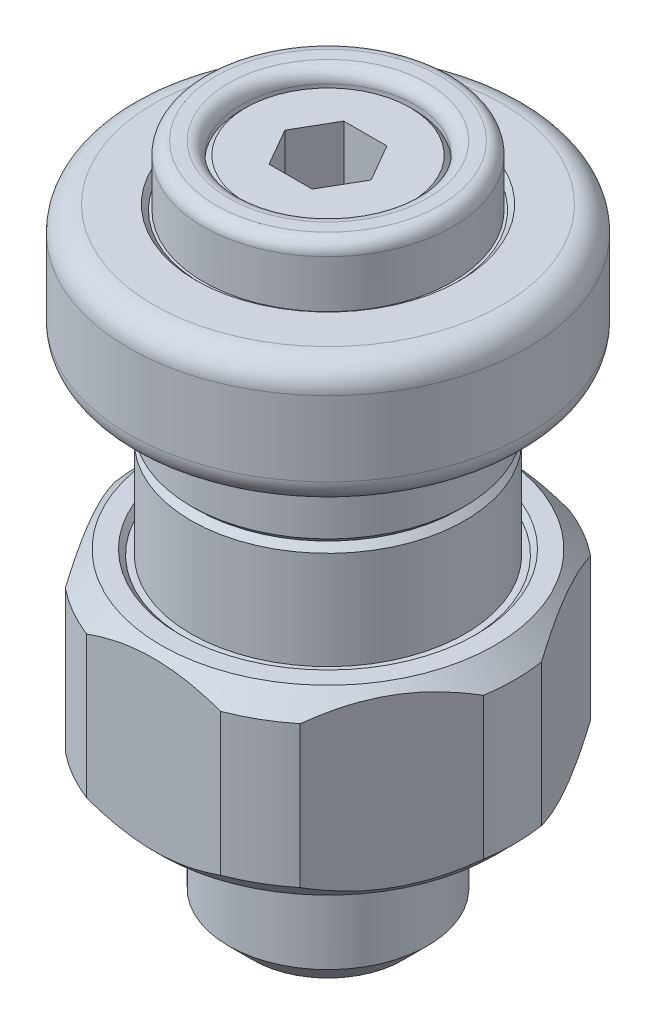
ISO-10303-21;
HEADER;
FILE_DESCRIPTION(('STEP AP214'),'2;1');
FILE_NAME('part.step','',(''),(''),'','','');
FILE_SCHEMA(('AUTOMOTIVE_DESIGN { 1 0 10303 214 1 1 1 1 }'));
ENDSEC;
DATA;
#1=APPLICATION_CONTEXT('core data for automotive mechanical design processes');
#2=APPLICATION_PROTOCOL_DEFINITION('international standard','automotive_design',2000,#1);
#3=PRODUCT_CONTEXT('',#1,'mechanical');
#4=PRODUCT('Part','Part','',(#3));
#5=PRODUCT_RELATED_PRODUCT_CATEGORY('part','',(#4));
#6=PRODUCT_DEFINITION_FORMATION('','',#4);
#7=PRODUCT_DEFINITION_CONTEXT('part definition',#1,'design');
#8=PRODUCT_DEFINITION('design','',#6,#7);
#9=PRODUCT_DEFINITION_SHAPE('','',#8);
#10=(LENGTH_UNIT() NAMED_UNIT(*) SI_UNIT(.MILLI.,.METRE.));
#11=(NAMED_UNIT(*) PLANE_ANGLE_UNIT() SI_UNIT($,.RADIAN.));
#12=(NAMED_UNIT(*) SI_UNIT($,.STERADIAN.) SOLID_ANGLE_UNIT());
#13=UNCERTAINTY_MEASURE_WITH_UNIT(LENGTH_MEASURE(1.E-05),#10,'distance_accuracy_value','');
#14=(GEOMETRIC_REPRESENTATION_CONTEXT(3) GLOBAL_UNCERTAINTY_ASSIGNED_CONTEXT((#13)) GLOBAL_UNIT_ASSIGNED_CONTEXT((#10,
#11,#12)) REPRESENTATION_CONTEXT('',''));
#15=CARTESIAN_POINT('',(0.,0.,0.));
#16=DIRECTION('',(0.,0.,1.));
#17=DIRECTION('',(1.,0.,0.));
#18=AXIS2_PLACEMENT_3D('',#15,#16,#17);
#19=CARTESIAN_POINT('',(0.,12.95,0.));
#20=DIRECTION('',(0.,1.,0.));
#21=DIRECTION('',(0.,0.,1.));
#22=AXIS2_PLACEMENT_3D('',#19,#20,#21);
#23=CONICAL_SURFACE('',#22,2.1,0.40715037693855);
#24=CARTESIAN_POINT('',(0.,12.95,0.));
#25=DIRECTION('',(0.,-1.,0.));
#26=DIRECTION('',(0.,0.,-1.));
#27=AXIS2_PLACEMENT_3D('',#24,#25,#26);
#28=CIRCLE('',#27,2.1);
#29=CARTESIAN_POINT('',(0.,12.95,-2.1));
#30=VERTEX_POINT('',#29);
#31=EDGE_CURVE('E531',#30,#30,#28,.T.);
#32=ORIENTED_EDGE('',*,*,#31,.F.);
#33=EDGE_LOOP('',(#32));
#34=FACE_BOUND('',#33,.T.);
#35=CARTESIAN_POINT('',(0.,12.7181145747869,0.));
#36=DIRECTION('',(0.,-1.,0.));
#37=DIRECTION('',(0.,0.,-1.));
#38=AXIS2_PLACEMENT_3D('',#35,#36,#37);
#39=CIRCLE('',#38,2.);
#40=CARTESIAN_POINT('',(1.97892156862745,12.7181145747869,0.289602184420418));
#41=VERTEX_POINT('',#40);
#42=CARTESIAN_POINT('',(0.289602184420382,12.7181145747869,1.97892156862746));
#43=VERTEX_POINT('',#42);
#44=EDGE_CURVE('E224',#41,#43,#39,.T.);
#45=ORIENTED_EDGE('',*,*,#44,.T.);
#46=CARTESIAN_POINT('',(0.289880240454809,12.7179145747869,1.97879368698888));
#47=CARTESIAN_POINT('',(0.270555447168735,12.7318553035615,1.98770934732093));
#48=CARTESIAN_POINT('',(0.249902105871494,12.7444729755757,1.99591025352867));
#49=CARTESIAN_POINT('',(0.206387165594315,12.7667017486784,2.01051026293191));
#50=CARTESIAN_POINT('',(0.183520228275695,12.7763053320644,2.01690485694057));
#51=CARTESIAN_POINT('',(0.136054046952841,12.7920970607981,2.02748832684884));
#52=CARTESIAN_POINT('',(0.111449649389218,12.7982745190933,2.03167029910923));
#53=CARTESIAN_POINT('',(0.0613398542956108,12.8068821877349,2.03751235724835));
#54=CARTESIAN_POINT('',(0.0358360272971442,12.8093186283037,2.03917663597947));
#55=CARTESIAN_POINT('',(-0.0139360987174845,12.8103193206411,2.03985936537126));
#56=CARTESIAN_POINT('',(-0.0381988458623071,12.809080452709,2.03901234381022));
#57=CARTESIAN_POINT('',(-0.0861297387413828,12.8032052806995,2.03501496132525));
#58=CARTESIAN_POINT('',(-0.109797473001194,12.7985666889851,2.03186304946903));
#59=CARTESIAN_POINT('',(-0.155640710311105,12.786147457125,2.02349305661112));
#60=CARTESIAN_POINT('',(-0.177828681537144,12.7783984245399,2.01829577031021));
#61=CARTESIAN_POINT('',(-0.220436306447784,12.7600527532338,2.00612868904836));
#62=CARTESIAN_POINT('',(-0.240857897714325,12.7494592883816,1.99916087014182));
#63=CARTESIAN_POINT('',(-0.270408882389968,12.7313878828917,1.98744123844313));
#64=CARTESIAN_POINT('',(-0.280305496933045,12.7248107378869,1.98320292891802));
#65=CARTESIAN_POINT('',(-0.289880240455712,12.7179145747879,1.97879368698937));
#66=B_SPLINE_CURVE_WITH_KNOTS('',3,(#46,#47,#48,#49,#50,#51,#52,#53,#54,#55,#56,#57,#58,#59,#60,
#61,#62,#63,#64,#65),.UNSPECIFIED.,.F.,.F.,(4,2,2,2,2,2,2,2,2,4),(0.,0.0763013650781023,
0.152791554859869,0.229519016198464,0.306118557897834,0.378690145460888,0.451310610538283,
0.523211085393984,0.595031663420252,0.632835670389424),.UNSPECIFIED.);
#67=CARTESIAN_POINT('',(-0.289602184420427,12.7181145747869,1.97892156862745));
#68=VERTEX_POINT('',#67);
#69=EDGE_CURVE('E205',#43,#68,#66,.T.);
#70=ORIENTED_EDGE('',*,*,#69,.T.);
#71=CARTESIAN_POINT('',(-1.97892156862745,12.7181145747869,0.289602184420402));
#72=VERTEX_POINT('',#71);
#73=EDGE_CURVE('E204',#68,#72,#39,.T.);
#74=ORIENTED_EDGE('',*,*,#73,.T.);
#75=CARTESIAN_POINT('',(-1.97879368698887,12.7179145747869,0.28988024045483));
#76=CARTESIAN_POINT('',(-1.98770934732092,12.7318553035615,0.270555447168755));
#77=CARTESIAN_POINT('',(-1.99591025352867,12.7444729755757,0.249902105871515));
#78=CARTESIAN_POINT('',(-2.01051026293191,12.7667017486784,0.206387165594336));
#79=CARTESIAN_POINT('',(-2.01690485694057,12.7763053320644,0.183520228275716));
#80=CARTESIAN_POINT('',(-2.02748832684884,12.7920970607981,0.136054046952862));
#81=CARTESIAN_POINT('',(-2.03167029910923,12.7982745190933,0.111449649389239));
#82=CARTESIAN_POINT('',(-2.03751235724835,12.8068821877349,0.0613398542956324));
#83=CARTESIAN_POINT('',(-2.03917663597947,12.8093186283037,0.0358360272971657));
#84=CARTESIAN_POINT('',(-2.03985936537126,12.8103193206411,-0.0139360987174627));
#85=CARTESIAN_POINT('',(-2.03901234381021,12.809080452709,-0.0381988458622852));
#86=CARTESIAN_POINT('',(-2.03501496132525,12.8032052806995,-0.0861297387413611));
#87=CARTESIAN_POINT('',(-2.03186304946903,12.7985666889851,-0.109797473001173));
#88=CARTESIAN_POINT('',(-2.02349305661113,12.786147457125,-0.155640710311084));
#89=CARTESIAN_POINT('',(-2.01829577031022,12.7783984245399,-0.177828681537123));
#90=CARTESIAN_POINT('',(-2.00612868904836,12.7600527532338,-0.220436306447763));
#91=CARTESIAN_POINT('',(-1.99916087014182,12.7494592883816,-0.240857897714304));
#92=CARTESIAN_POINT('',(-1.98744123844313,12.7313878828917,-0.270408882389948));
#93=CARTESIAN_POINT('',(-1.98320292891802,12.7248107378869,-0.280305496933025));
#94=CARTESIAN_POINT('',(-1.97879368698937,12.7179145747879,-0.289880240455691));
#95=B_SPLINE_CURVE_WITH_KNOTS('',3,(#75,#76,#77,#78,#79,#80,#81,#82,#83,#84,#85,#86,#87,#88,#89,
#90,#91,#92,#93,#94),.UNSPECIFIED.,.F.,.F.,(4,2,2,2,2,2,2,2,2,4),(0.,0.0763013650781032,
0.15279155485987,0.229519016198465,0.306118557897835,0.378690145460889,0.451310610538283,
0.523211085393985,0.595031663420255,0.632835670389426),.UNSPECIFIED.);
#96=CARTESIAN_POINT('',(-1.97892156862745,12.7181145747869,-0.289602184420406));
#97=VERTEX_POINT('',#96);
#98=EDGE_CURVE('E439',#72,#97,#95,.T.);
#99=ORIENTED_EDGE('',*,*,#98,.T.);
#100=CARTESIAN_POINT('',(-0.289602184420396,12.7181145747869,-1.97892156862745));
#101=VERTEX_POINT('',#100);
#102=EDGE_CURVE('E225',#97,#101,#39,.T.);
#103=ORIENTED_EDGE('',*,*,#102,.T.);
#104=CARTESIAN_POINT('',(-0.289880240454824,12.7179145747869,-1.97879368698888));
#105=CARTESIAN_POINT('',(-0.270555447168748,12.7318553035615,-1.98770934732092));
#106=CARTESIAN_POINT('',(-0.249902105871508,12.7444729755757,-1.99591025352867));
#107=CARTESIAN_POINT('',(-0.206387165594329,12.7667017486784,-2.01051026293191));
#108=CARTESIAN_POINT('',(-0.183520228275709,12.7763053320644,-2.01690485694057));
#109=CARTESIAN_POINT('',(-0.136054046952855,12.7920970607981,-2.02748832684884));
#110=CARTESIAN_POINT('',(-0.111449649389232,12.7982745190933,-2.03167029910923));
#111=CARTESIAN_POINT('',(-0.0613398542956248,12.8068821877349,-2.03751235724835));
#112=CARTESIAN_POINT('',(-0.0358360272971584,12.8093186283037,-2.03917663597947));
#113=CARTESIAN_POINT('',(0.01393609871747,12.8103193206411,-2.03985936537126));
#114=CARTESIAN_POINT('',(0.0381988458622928,12.809080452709,-2.03901234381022));
#115=CARTESIAN_POINT('',(0.0861297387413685,12.8032052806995,-2.03501496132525));
#116=CARTESIAN_POINT('',(0.10979747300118,12.7985666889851,-2.03186304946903));
#117=CARTESIAN_POINT('',(0.155640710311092,12.786147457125,-2.02349305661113));
#118=CARTESIAN_POINT('',(0.177828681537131,12.7783984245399,-2.01829577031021));
#119=CARTESIAN_POINT('',(0.220436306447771,12.7600527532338,-2.00612868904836));
#120=CARTESIAN_POINT('',(0.240857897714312,12.7494592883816,-1.99916087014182));
#121=CARTESIAN_POINT('',(0.270408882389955,12.7313878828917,-1.98744123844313));
#122=CARTESIAN_POINT('',(0.280305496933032,12.7248107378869,-1.98320292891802));
#123=CARTESIAN_POINT('',(0.289880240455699,12.7179145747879,-1.97879368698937));
#124=B_SPLINE_CURVE_WITH_KNOTS('',3,(#104,#105,#106,#107,#108,#109,#110,#111,#112,#113,#114,
#115,#116,#117,#118,#119,#120,#121,#122,#123),.UNSPECIFIED.,.F.,.F.,(4,2,2,2,2,2,2,2,2,4),(0.,
0.0763013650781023,0.152791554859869,0.229519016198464,0.306118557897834,0.378690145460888,
0.451310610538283,0.523211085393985,0.595031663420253,0.632835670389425),.UNSPECIFIED.);
#125=CARTESIAN_POINT('',(0.289602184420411,12.7181145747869,-1.97892156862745));
#126=VERTEX_POINT('',#125);
#127=EDGE_CURVE('E345',#101,#126,#124,.T.);
#128=ORIENTED_EDGE('',*,*,#127,.T.);
#129=CARTESIAN_POINT('',(1.97892156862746,12.7181145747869,-0.289602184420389));
#130=VERTEX_POINT('',#129);
#131=EDGE_CURVE('E342',#126,#130,#39,.T.);
#132=ORIENTED_EDGE('',*,*,#131,.T.);
#133=CARTESIAN_POINT('',(1.97879368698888,12.7179145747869,-0.289880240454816));
#134=CARTESIAN_POINT('',(1.98770934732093,12.7318553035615,-0.270555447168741));
#135=CARTESIAN_POINT('',(1.99591025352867,12.7444729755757,-0.249902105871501));
#136=CARTESIAN_POINT('',(2.01051026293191,12.7667017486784,-0.206387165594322));
#137=CARTESIAN_POINT('',(2.01690485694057,12.7763053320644,-0.183520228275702));
#138=CARTESIAN_POINT('',(2.02748832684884,12.7920970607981,-0.136054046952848));
#139=CARTESIAN_POINT('',(2.03167029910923,12.7982745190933,-0.111449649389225));
#140=CARTESIAN_POINT('',(2.03751235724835,12.8068821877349,-0.0613398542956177));
#141=CARTESIAN_POINT('',(2.03917663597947,12.8093186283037,-0.035836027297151));
#142=CARTESIAN_POINT('',(2.03985936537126,12.8103193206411,0.0139360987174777));
#143=CARTESIAN_POINT('',(2.03901234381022,12.809080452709,0.0381988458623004));
#144=CARTESIAN_POINT('',(2.03501496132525,12.8032052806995,0.0861297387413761));
#145=CARTESIAN_POINT('',(2.03186304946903,12.7985666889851,0.109797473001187));
#146=CARTESIAN_POINT('',(2.02349305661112,12.786147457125,0.155640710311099));
#147=CARTESIAN_POINT('',(2.01829577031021,12.7783984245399,0.177828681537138));
#148=CARTESIAN_POINT('',(2.00612868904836,12.7600527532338,0.220436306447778));
#149=CARTESIAN_POINT('',(1.99916087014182,12.7494592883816,0.240857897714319));
#150=CARTESIAN_POINT('',(1.98744123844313,12.7313878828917,0.270408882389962));
#151=CARTESIAN_POINT('',(1.98320292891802,12.7248107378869,0.280305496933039));
#152=CARTESIAN_POINT('',(1.97879368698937,12.7179145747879,0.289880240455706));
#153=B_SPLINE_CURVE_WITH_KNOTS('',3,(#133,#134,#135,#136,#137,#138,#139,#140,#141,#142,#143,
#144,#145,#146,#147,#148,#149,#150,#151,#152),.UNSPECIFIED.,.F.,.F.,(4,2,2,2,2,2,2,2,2,4),(0.,
0.0763013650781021,0.152791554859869,0.229519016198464,0.306118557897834,0.378690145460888,
0.451310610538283,0.523211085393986,0.595031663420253,0.632835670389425),.UNSPECIFIED.);
#154=EDGE_CURVE('E275',#130,#41,#153,.T.);
#155=ORIENTED_EDGE('',*,*,#154,.T.);
#156=EDGE_LOOP('',(#45,#70,#74,#99,#103,#128,#132,#155));
#157=FACE_BOUND('',#156,.T.);
#158=ADVANCED_FACE('F15',(#34,#157),#23,.F.);
#159=CARTESIAN_POINT('',(0.,0.,0.));
#160=DIRECTION('',(0.,-1.,0.));
#161=DIRECTION('',(0.,0.,-1.));
#162=AXIS2_PLACEMENT_3D('',#159,#160,#161);
#163=CYLINDRICAL_SURFACE('',#162,2.);
#164=ORIENTED_EDGE('',*,*,#73,.F.);
#165=CARTESIAN_POINT('',(-0.289190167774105,12.7183145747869,1.97898182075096));
#166=CARTESIAN_POINT('',(-0.328317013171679,12.6993809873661,1.97327655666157));
#167=CARTESIAN_POINT('',(-0.365368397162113,12.676744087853,1.96666468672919));
#168=CARTESIAN_POINT('',(-0.434477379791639,12.625394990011,1.95255040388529));
#169=CARTESIAN_POINT('',(-0.466562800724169,12.5967189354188,1.94505340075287));
#170=CARTESIAN_POINT('',(-0.525277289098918,12.5344702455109,1.93002765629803));
#171=CARTESIAN_POINT('',(-0.551922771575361,12.5009128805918,1.92249908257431));
#172=CARTESIAN_POINT('',(-0.599678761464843,12.4298842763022,1.90814236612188));
#173=CARTESIAN_POINT('',(-0.62078135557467,12.3924075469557,1.9013152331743));
#174=CARTESIAN_POINT('',(-0.658518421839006,12.3119905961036,1.88859162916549));
#175=CARTESIAN_POINT('',(-0.674762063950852,12.2688527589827,1.88278733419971));
#176=CARTESIAN_POINT('',(-0.700761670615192,12.1804568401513,1.87326570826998));
#177=CARTESIAN_POINT('',(-0.710516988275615,12.1351985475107,1.86954858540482));
#178=CARTESIAN_POINT('',(-0.724146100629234,12.0394513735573,1.86431572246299));
#179=CARTESIAN_POINT('',(-0.727404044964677,11.988861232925,1.86303103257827));
#180=CARTESIAN_POINT('',(-0.726218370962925,11.8877757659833,1.86349306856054));
#181=CARTESIAN_POINT('',(-0.72177248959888,11.8372804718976,1.86524068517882));
#182=CARTESIAN_POINT('',(-0.704922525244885,11.736306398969,1.87167534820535));
#183=CARTESIAN_POINT('',(-0.692292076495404,11.6858703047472,1.87644591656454));
#184=CARTESIAN_POINT('',(-0.658832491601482,11.5880570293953,1.88845280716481));
#185=CARTESIAN_POINT('',(-0.637999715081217,11.5406812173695,1.89569022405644));
#186=CARTESIAN_POINT('',(-0.58899099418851,11.4520865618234,1.91147335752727));
#187=CARTESIAN_POINT('',(-0.561064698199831,11.4107216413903,1.91997115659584));
#188=CARTESIAN_POINT('',(-0.497898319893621,11.3341850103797,1.93730733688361));
#189=CARTESIAN_POINT('',(-0.46267957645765,11.2989957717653,1.94614466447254));
#190=CARTESIAN_POINT('',(-0.403478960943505,11.2509646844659,1.95899304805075));
#191=CARTESIAN_POINT('',(-0.381816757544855,11.2353063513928,1.96334852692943));
#192=CARTESIAN_POINT('',(-0.336757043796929,11.2065246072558,1.97157862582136));
#193=CARTESIAN_POINT('',(-0.313357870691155,11.1934036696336,1.97545277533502));
#194=CARTESIAN_POINT('',(-0.289190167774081,11.1816854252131,1.97898182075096));
#195=B_SPLINE_CURVE_WITH_KNOTS('',3,(#165,#166,#167,#168,#169,#170,#171,#172,#173,#174,#175,
#176,#177,#178,#179,#180,#181,#182,#183,#184,#185,#186,#187,#188,#189,#190,#191,#192,#193,#194),
.UNSPECIFIED.,.F.,.F.,(4,2,2,2,2,2,2,2,2,2,2,2,2,2,4),(0.,0.131119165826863,0.261474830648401,
0.391431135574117,0.521571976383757,0.660373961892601,0.799189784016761,0.950635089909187,
1.10212489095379,1.25799445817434,1.41393328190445,1.56500208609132,1.71563493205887,
1.7967187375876,1.87788118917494),.UNSPECIFIED.);
#196=CARTESIAN_POINT('',(-0.289602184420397,11.1818854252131,1.97892156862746));
#197=VERTEX_POINT('',#196);
#198=EDGE_CURVE('E192',#68,#197,#195,.T.);
#199=ORIENTED_EDGE('',*,*,#198,.T.);
#200=CARTESIAN_POINT('',(0.,11.1818854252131,0.));
#201=DIRECTION('',(0.,-1.,0.));
#202=DIRECTION('',(0.,0.,-1.));
#203=AXIS2_PLACEMENT_3D('',#200,#201,#202);
#204=CIRCLE('',#203,2.);
#205=CARTESIAN_POINT('',(-1.97892156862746,11.1818854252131,0.289602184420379));
#206=VERTEX_POINT('',#205);
#207=EDGE_CURVE('E202',#197,#206,#204,.T.);
#208=ORIENTED_EDGE('',*,*,#207,.T.);
#209=CARTESIAN_POINT('',(-1.97898182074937,11.1816854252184,0.289190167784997));
#210=CARTESIAN_POINT('',(-1.97327655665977,11.20061901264,0.328317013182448));
#211=CARTESIAN_POINT('',(-1.96666468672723,11.2232559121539,0.365368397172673));
#212=CARTESIAN_POINT('',(-1.95255040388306,11.2746050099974,0.434477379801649));
#213=CARTESIAN_POINT('',(-1.94505340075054,11.3032810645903,0.466562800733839));
#214=CARTESIAN_POINT('',(-1.9300276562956,11.3655297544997,0.525277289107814));
#215=CARTESIAN_POINT('',(-1.92249908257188,11.3990871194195,0.551922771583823));
#216=CARTESIAN_POINT('',(-1.90814236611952,11.4701157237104,0.599678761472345));
#217=CARTESIAN_POINT('',(-1.90131523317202,11.5075924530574,0.620781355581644));
#218=CARTESIAN_POINT('',(-1.88859162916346,11.5880094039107,0.658518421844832));
#219=CARTESIAN_POINT('',(-1.88278733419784,11.6311472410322,0.674762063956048));
#220=CARTESIAN_POINT('',(-1.87326570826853,11.7195431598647,0.700761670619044));
#221=CARTESIAN_POINT('',(-1.86954858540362,11.7648014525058,0.710516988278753));
#222=CARTESIAN_POINT('',(-1.86431572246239,11.8605486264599,0.724146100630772));
#223=CARTESIAN_POINT('',(-1.86303103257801,11.9111387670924,0.727404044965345));
#224=CARTESIAN_POINT('',(-1.86349306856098,12.0122242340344,0.726218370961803));
#225=CARTESIAN_POINT('',(-1.86524068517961,12.0627195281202,0.721772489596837));
#226=CARTESIAN_POINT('',(-1.87167534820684,12.1636936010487,0.704922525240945));
#227=CARTESIAN_POINT('',(-1.87644591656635,12.2141296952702,0.692292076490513));
#228=CARTESIAN_POINT('',(-1.88845280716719,12.3119429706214,0.658832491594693));
#229=CARTESIAN_POINT('',(-1.89569022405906,12.3593187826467,0.637999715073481));
#230=CARTESIAN_POINT('',(-1.9114733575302,12.4479134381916,0.588990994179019));
#231=CARTESIAN_POINT('',(-1.91997115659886,12.4892783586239,0.561064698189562));
#232=CARTESIAN_POINT('',(-1.93730733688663,12.5658149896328,0.49789831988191));
#233=CARTESIAN_POINT('',(-1.9461446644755,12.6010042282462,0.462679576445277));
#234=CARTESIAN_POINT('',(-1.9589930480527,12.6490353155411,0.403478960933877));
#235=CARTESIAN_POINT('',(-1.96334852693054,12.6646936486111,0.381816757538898));
#236=CARTESIAN_POINT('',(-1.97157862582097,12.6934753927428,0.336757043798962));
#237=CARTESIAN_POINT('',(-1.97545277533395,12.7065963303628,0.31335787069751));
#238=CARTESIAN_POINT('',(-1.97898182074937,12.7183145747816,0.289190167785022));
#239=B_SPLINE_CURVE_WITH_KNOTS('',3,(#209,#210,#211,#212,#213,#214,#215,#216,#217,#218,#219,
#220,#221,#222,#223,#224,#225,#226,#227,#228,#229,#230,#231,#232,#233,#234,#235,#236,#237,#238),
.UNSPECIFIED.,.F.,.F.,(4,2,2,2,2,2,2,2,2,2,2,2,2,2,4),(0.,0.131119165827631,0.261474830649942,
0.391431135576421,0.521571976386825,0.660373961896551,0.799189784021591,0.950635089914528,
1.10212489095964,1.2579944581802,1.41393328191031,1.56500208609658,1.71563493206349,
1.79671873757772,1.87788118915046),.UNSPECIFIED.);
#240=EDGE_CURVE('E291',#206,#72,#239,.T.);
#241=ORIENTED_EDGE('',*,*,#240,.T.);
#242=EDGE_LOOP('',(#164,#199,#208,#241));
#243=FACE_BOUND('',#242,.T.);
#244=ADVANCED_FACE('F200',(#243),#163,.F.);
#245=CARTESIAN_POINT('',(1.97892156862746,11.1818854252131,0.289602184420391));
#246=VERTEX_POINT('',#245);
#247=CARTESIAN_POINT('',(0.289602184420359,11.1818854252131,1.97892156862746));
#248=VERTEX_POINT('',#247);
#249=EDGE_CURVE('E211',#246,#248,#204,.T.);
#250=ORIENTED_EDGE('',*,*,#249,.T.);
#251=CARTESIAN_POINT('',(0.289190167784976,11.1816854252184,1.97898182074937));
#252=CARTESIAN_POINT('',(0.328317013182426,11.20061901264,1.97327655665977));
#253=CARTESIAN_POINT('',(0.365368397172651,11.2232559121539,1.96666468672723));
#254=CARTESIAN_POINT('',(0.434477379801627,11.2746050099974,1.95255040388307));
#255=CARTESIAN_POINT('',(0.466562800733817,11.3032810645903,1.94505340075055));
#256=CARTESIAN_POINT('',(0.525277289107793,11.3655297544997,1.93002765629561));
#257=CARTESIAN_POINT('',(0.551922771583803,11.3990871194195,1.92249908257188));
#258=CARTESIAN_POINT('',(0.599678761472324,11.4701157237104,1.90814236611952));
#259=CARTESIAN_POINT('',(0.620781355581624,11.5075924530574,1.90131523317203));
#260=CARTESIAN_POINT('',(0.658518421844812,11.5880094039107,1.88859162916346));
#261=CARTESIAN_POINT('',(0.674762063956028,11.6311472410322,1.88278733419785));
#262=CARTESIAN_POINT('',(0.700761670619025,11.7195431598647,1.87326570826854));
#263=CARTESIAN_POINT('',(0.710516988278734,11.7648014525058,1.86954858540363));
#264=CARTESIAN_POINT('',(0.724146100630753,11.8605486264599,1.8643157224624));
#265=CARTESIAN_POINT('',(0.727404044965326,11.9111387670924,1.86303103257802));
#266=CARTESIAN_POINT('',(0.726218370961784,12.0122242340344,1.86349306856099));
#267=CARTESIAN_POINT('',(0.721772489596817,12.0627195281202,1.86524068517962));
#268=CARTESIAN_POINT('',(0.704922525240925,12.1636936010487,1.87167534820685));
#269=CARTESIAN_POINT('',(0.692292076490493,12.2141296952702,1.87644591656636));
#270=CARTESIAN_POINT('',(0.658832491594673,12.3119429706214,1.8884528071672));
#271=CARTESIAN_POINT('',(0.637999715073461,12.3593187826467,1.89569022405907));
#272=CARTESIAN_POINT('',(0.588990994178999,12.4479134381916,1.91147335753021));
#273=CARTESIAN_POINT('',(0.561064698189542,12.4892783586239,1.91997115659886));
#274=CARTESIAN_POINT('',(0.49789831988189,12.5658149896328,1.93730733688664));
#275=CARTESIAN_POINT('',(0.462679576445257,12.6010042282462,1.9461446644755));
#276=CARTESIAN_POINT('',(0.403478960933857,12.6490353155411,1.9589930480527));
#277=CARTESIAN_POINT('',(0.381816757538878,12.6646936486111,1.96334852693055));
#278=CARTESIAN_POINT('',(0.336757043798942,12.6934753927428,1.97157862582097));
#279=CARTESIAN_POINT('',(0.31335787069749,12.7065963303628,1.97545277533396));
#280=CARTESIAN_POINT('',(0.289190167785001,12.7183145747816,1.97898182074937));
#281=B_SPLINE_CURVE_WITH_KNOTS('',3,(#251,#252,#253,#254,#255,#256,#257,#258,#259,#260,#261,
#262,#263,#264,#265,#266,#267,#268,#269,#270,#271,#272,#273,#274,#275,#276,#277,#278,#279,#280),
.UNSPECIFIED.,.F.,.F.,(4,2,2,2,2,2,2,2,2,2,2,2,2,2,4),(0.,0.13111916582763,0.261474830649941,
0.39143113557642,0.521571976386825,0.660373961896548,0.799189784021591,0.950635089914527,
1.10212489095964,1.2579944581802,1.41393328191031,1.56500208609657,1.71563493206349,
1.79671873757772,1.87788118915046),.UNSPECIFIED.);
#282=EDGE_CURVE('E36',#248,#43,#281,.T.);
#283=ORIENTED_EDGE('',*,*,#282,.T.);
#284=ORIENTED_EDGE('',*,*,#44,.F.);
#285=CARTESIAN_POINT('',(1.97898182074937,12.7183145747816,0.289190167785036));
#286=CARTESIAN_POINT('',(1.97327655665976,12.69938098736,0.328317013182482));
#287=CARTESIAN_POINT('',(1.96666468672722,12.6767440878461,0.365368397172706));
#288=CARTESIAN_POINT('',(1.95255040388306,12.6253949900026,0.434477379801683));
#289=CARTESIAN_POINT('',(1.94505340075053,12.5967189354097,0.466562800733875));
#290=CARTESIAN_POINT('',(1.9300276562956,12.5344702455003,0.525277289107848));
#291=CARTESIAN_POINT('',(1.92249908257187,12.5009128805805,0.551922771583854));
#292=CARTESIAN_POINT('',(1.90814236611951,12.4298842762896,0.599678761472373));
#293=CARTESIAN_POINT('',(1.90131523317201,12.3924075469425,0.620781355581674));
#294=CARTESIAN_POINT('',(1.88859162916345,12.3119905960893,0.658518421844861));
#295=CARTESIAN_POINT('',(1.88278733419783,12.2688527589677,0.674762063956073));
#296=CARTESIAN_POINT('',(1.87326570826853,12.1804568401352,0.700761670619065));
#297=CARTESIAN_POINT('',(1.86954858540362,12.1351985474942,0.710516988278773));
#298=CARTESIAN_POINT('',(1.86431572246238,12.03945137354,0.724146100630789));
#299=CARTESIAN_POINT('',(1.863031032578,11.9888612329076,0.727404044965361));
#300=CARTESIAN_POINT('',(1.86349306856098,11.8877757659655,0.726218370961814));
#301=CARTESIAN_POINT('',(1.86524068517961,11.8372804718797,0.721772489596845));
#302=CARTESIAN_POINT('',(1.87167534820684,11.7363063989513,0.704922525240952));
#303=CARTESIAN_POINT('',(1.87644591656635,11.6858703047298,0.692292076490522));
#304=CARTESIAN_POINT('',(1.88845280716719,11.5880570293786,0.658832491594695));
#305=CARTESIAN_POINT('',(1.89569022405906,11.5406812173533,0.637999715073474));
#306=CARTESIAN_POINT('',(1.9114733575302,11.4520865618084,0.588990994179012));
#307=CARTESIAN_POINT('',(1.91997115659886,11.4107216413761,0.561064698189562));
#308=CARTESIAN_POINT('',(1.93730733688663,11.3341850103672,0.497898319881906));
#309=CARTESIAN_POINT('',(1.9461446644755,11.2989957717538,0.462679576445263));
#310=CARTESIAN_POINT('',(1.9589930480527,11.2509646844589,0.403478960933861));
#311=CARTESIAN_POINT('',(1.96334852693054,11.2353063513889,0.381816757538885));
#312=CARTESIAN_POINT('',(1.97157862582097,11.2065246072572,0.336757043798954));
#313=CARTESIAN_POINT('',(1.97545277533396,11.1934036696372,0.313357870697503));
#314=CARTESIAN_POINT('',(1.97898182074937,11.1816854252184,0.289190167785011));
#315=B_SPLINE_CURVE_WITH_KNOTS('',3,(#285,#286,#287,#288,#289,#290,#291,#292,#293,#294,#295,
#296,#297,#298,#299,#300,#301,#302,#303,#304,#305,#306,#307,#308,#309,#310,#311,#312,#313,#314),
.UNSPECIFIED.,.F.,.F.,(4,2,2,2,2,2,2,2,2,2,2,2,2,2,4),(0.,0.131119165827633,0.261474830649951,
0.391431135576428,0.52157197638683,0.660373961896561,0.799189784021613,0.950635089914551,
1.10212489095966,1.2579944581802,1.4139332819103,1.56500208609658,1.7156349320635,
1.79671873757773,1.87788118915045),.UNSPECIFIED.);
#316=EDGE_CURVE('E270',#41,#246,#315,.T.);
#317=ORIENTED_EDGE('',*,*,#316,.T.);
#318=EDGE_LOOP('',(#250,#283,#284,#317));
#319=FACE_BOUND('',#318,.T.);
#320=ADVANCED_FACE('F284',(#319),#163,.F.);
#321=CARTESIAN_POINT('',(0.,11.1818854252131,0.));
#322=DIRECTION('',(0.,-1.,0.));
#323=DIRECTION('',(0.,0.,-1.));
#324=AXIS2_PLACEMENT_3D('',#321,#322,#323);
#325=CONICAL_SURFACE('',#324,2.,0.407150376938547);
#326=CARTESIAN_POINT('',(0.,10.95,0.));
#327=DIRECTION('',(0.,-1.,0.));
#328=DIRECTION('',(0.,0.,-1.));
#329=AXIS2_PLACEMENT_3D('',#326,#327,#328);
#330=CIRCLE('',#329,2.1);
#331=CARTESIAN_POINT('',(0.,10.95,-2.1));
#332=VERTEX_POINT('',#331);
#333=EDGE_CURVE('E212',#332,#332,#330,.T.);
#334=ORIENTED_EDGE('',*,*,#333,.T.);
#335=EDGE_LOOP('',(#334));
#336=FACE_BOUND('',#335,.T.);
#337=ORIENTED_EDGE('',*,*,#207,.F.);
#338=CARTESIAN_POINT('',(-0.289880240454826,11.1820854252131,1.97879368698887));
#339=CARTESIAN_POINT('',(-0.27055544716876,11.1681446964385,1.98770934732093));
#340=CARTESIAN_POINT('',(-0.249902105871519,11.1555270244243,1.99591025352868));
#341=CARTESIAN_POINT('',(-0.206387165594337,11.1332982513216,2.01051026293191));
#342=CARTESIAN_POINT('',(-0.183520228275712,11.1236946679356,2.01690485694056));
#343=CARTESIAN_POINT('',(-0.136054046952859,11.1079029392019,2.02748832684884));
#344=CARTESIAN_POINT('',(-0.111449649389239,11.1017254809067,2.03167029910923));
#345=CARTESIAN_POINT('',(-0.0613398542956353,11.0931178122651,2.03751235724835));
#346=CARTESIAN_POINT('',(-0.0358360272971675,11.0906813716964,2.03917663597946));
#347=CARTESIAN_POINT('',(0.0139360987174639,11.0896806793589,2.03985936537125));
#348=CARTESIAN_POINT('',(0.0381988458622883,11.090919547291,2.03901234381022));
#349=CARTESIAN_POINT('',(0.086129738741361,11.0967947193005,2.03501496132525));
#350=CARTESIAN_POINT('',(0.109797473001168,11.1014333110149,2.03186304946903));
#351=CARTESIAN_POINT('',(0.155640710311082,11.113852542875,2.02349305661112));
#352=CARTESIAN_POINT('',(0.177828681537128,11.1216015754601,2.01829577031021));
#353=CARTESIAN_POINT('',(0.220436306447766,11.1399472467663,2.00612868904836));
#354=CARTESIAN_POINT('',(0.240857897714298,11.1505407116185,1.99916087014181));
#355=CARTESIAN_POINT('',(0.270408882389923,11.1686121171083,1.98744123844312));
#356=CARTESIAN_POINT('',(0.280305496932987,11.1751892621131,1.98320292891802));
#357=CARTESIAN_POINT('',(0.289880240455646,11.1820854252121,1.97879368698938));
#358=B_SPLINE_CURVE_WITH_KNOTS('',3,(#338,#339,#340,#341,#342,#343,#344,#345,#346,#347,#348,
#349,#350,#351,#352,#353,#354,#355,#356,#357),.UNSPECIFIED.,.F.,.F.,(4,2,2,2,2,2,2,2,2,4),(0.,
0.0763013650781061,0.152791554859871,0.229519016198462,0.306118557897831,0.378690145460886,
0.451310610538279,0.523211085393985,0.595031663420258,0.632835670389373),.UNSPECIFIED.);
#359=EDGE_CURVE('E9',#197,#248,#358,.T.);
#360=ORIENTED_EDGE('',*,*,#359,.T.);
#361=ORIENTED_EDGE('',*,*,#249,.F.);
#362=CARTESIAN_POINT('',(1.97879368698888,11.1820854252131,0.289880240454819));
#363=CARTESIAN_POINT('',(1.98770934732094,11.1681446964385,0.270555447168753));
#364=CARTESIAN_POINT('',(1.99591025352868,11.1555270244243,0.249902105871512));
#365=CARTESIAN_POINT('',(2.01051026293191,11.1332982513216,0.206387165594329));
#366=CARTESIAN_POINT('',(2.01690485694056,11.1236946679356,0.183520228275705));
#367=CARTESIAN_POINT('',(2.02748832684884,11.1079029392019,0.136054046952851));
#368=CARTESIAN_POINT('',(2.03167029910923,11.1017254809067,0.111449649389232));
#369=CARTESIAN_POINT('',(2.03751235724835,11.0931178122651,0.0613398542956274));
#370=CARTESIAN_POINT('',(2.03917663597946,11.0906813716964,0.0358360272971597));
#371=CARTESIAN_POINT('',(2.03985936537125,11.0896806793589,-0.0139360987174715));
#372=CARTESIAN_POINT('',(2.03901234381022,11.0909195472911,-0.0381988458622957));
#373=CARTESIAN_POINT('',(2.03501496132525,11.0967947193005,-0.0861297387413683));
#374=CARTESIAN_POINT('',(2.03186304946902,11.1014333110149,-0.109797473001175));
#375=CARTESIAN_POINT('',(2.02349305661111,11.113852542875,-0.155640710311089));
#376=CARTESIAN_POINT('',(2.01829577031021,11.1216015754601,-0.177828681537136));
#377=CARTESIAN_POINT('',(2.00612868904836,11.1399472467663,-0.220436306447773));
#378=CARTESIAN_POINT('',(1.99916087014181,11.1505407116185,-0.240857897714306));
#379=CARTESIAN_POINT('',(1.98744123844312,11.1686121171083,-0.27040888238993));
#380=CARTESIAN_POINT('',(1.98320292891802,11.1751892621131,-0.280305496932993));
#381=CARTESIAN_POINT('',(1.97879368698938,11.1820854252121,-0.289880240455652));
#382=B_SPLINE_CURVE_WITH_KNOTS('',3,(#362,#363,#364,#365,#366,#367,#368,#369,#370,#371,#372,
#373,#374,#375,#376,#377,#378,#379,#380,#381),.UNSPECIFIED.,.F.,.F.,(4,2,2,2,2,2,2,2,2,4),(0.,
0.0763013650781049,0.15279155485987,0.229519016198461,0.30611855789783,0.378690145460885,
0.451310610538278,0.523211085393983,0.595031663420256,0.632835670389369),.UNSPECIFIED.);
#383=CARTESIAN_POINT('',(1.97892156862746,11.1818854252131,-0.289602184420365));
#384=VERTEX_POINT('',#383);
#385=EDGE_CURVE('E29',#246,#384,#382,.T.);
#386=ORIENTED_EDGE('',*,*,#385,.T.);
#387=CARTESIAN_POINT('',(0.289602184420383,11.1818854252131,-1.97892156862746));
#388=VERTEX_POINT('',#387);
#389=EDGE_CURVE('E215',#388,#384,#204,.T.);
#390=ORIENTED_EDGE('',*,*,#389,.F.);
#391=CARTESIAN_POINT('',(0.289880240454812,11.1820854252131,-1.97879368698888));
#392=CARTESIAN_POINT('',(0.270555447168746,11.1681446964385,-1.98770934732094));
#393=CARTESIAN_POINT('',(0.249902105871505,11.1555270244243,-1.99591025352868));
#394=CARTESIAN_POINT('',(0.206387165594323,11.1332982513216,-2.01051026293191));
#395=CARTESIAN_POINT('',(0.183520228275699,11.1236946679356,-2.01690485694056));
#396=CARTESIAN_POINT('',(0.136054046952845,11.1079029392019,-2.02748832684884));
#397=CARTESIAN_POINT('',(0.111449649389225,11.1017254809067,-2.03167029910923));
#398=CARTESIAN_POINT('',(0.0613398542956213,11.0931178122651,-2.03751235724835));
#399=CARTESIAN_POINT('',(0.0358360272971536,11.0906813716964,-2.03917663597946));
#400=CARTESIAN_POINT('',(-0.0139360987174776,11.0896806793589,-2.03985936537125));
#401=CARTESIAN_POINT('',(-0.0381988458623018,11.0909195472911,-2.03901234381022));
#402=CARTESIAN_POINT('',(-0.0861297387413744,11.0967947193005,-2.03501496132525));
#403=CARTESIAN_POINT('',(-0.109797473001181,11.1014333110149,-2.03186304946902));
#404=CARTESIAN_POINT('',(-0.155640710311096,11.113852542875,-2.02349305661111));
#405=CARTESIAN_POINT('',(-0.177828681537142,11.1216015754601,-2.01829577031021));
#406=CARTESIAN_POINT('',(-0.22043630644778,11.1399472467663,-2.00612868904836));
#407=CARTESIAN_POINT('',(-0.240857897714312,11.1505407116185,-1.99916087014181));
#408=CARTESIAN_POINT('',(-0.270408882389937,11.1686121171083,-1.98744123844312));
#409=CARTESIAN_POINT('',(-0.280305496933,11.1751892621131,-1.98320292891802));
#410=CARTESIAN_POINT('',(-0.289880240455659,11.1820854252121,-1.97879368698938));
#411=B_SPLINE_CURVE_WITH_KNOTS('',3,(#391,#392,#393,#394,#395,#396,#397,#398,#399,#400,#401,
#402,#403,#404,#405,#406,#407,#408,#409,#410),.UNSPECIFIED.,.F.,.F.,(4,2,2,2,2,2,2,2,2,4),(0.,
0.0763013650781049,0.152791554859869,0.229519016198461,0.306118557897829,0.378690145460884,
0.451310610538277,0.523211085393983,0.595031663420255,0.632835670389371),.UNSPECIFIED.);
#412=CARTESIAN_POINT('',(-0.289602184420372,11.1818854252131,-1.97892156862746));
#413=VERTEX_POINT('',#412);
#414=EDGE_CURVE('E235',#388,#413,#411,.T.);
#415=ORIENTED_EDGE('',*,*,#414,.T.);
#416=CARTESIAN_POINT('',(-1.97892156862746,11.1818854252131,-0.289602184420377));
#417=VERTEX_POINT('',#416);
#418=EDGE_CURVE('E214',#417,#413,#204,.T.);
#419=ORIENTED_EDGE('',*,*,#418,.F.);
#420=CARTESIAN_POINT('',(-1.97879368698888,11.1820854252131,-0.289880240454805));
#421=CARTESIAN_POINT('',(-1.98770934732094,11.1681446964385,-0.270555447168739));
#422=CARTESIAN_POINT('',(-1.99591025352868,11.1555270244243,-0.249902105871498));
#423=CARTESIAN_POINT('',(-2.01051026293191,11.1332982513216,-0.206387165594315));
#424=CARTESIAN_POINT('',(-2.01690485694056,11.1236946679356,-0.18352022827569));
#425=CARTESIAN_POINT('',(-2.02748832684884,11.1079029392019,-0.136054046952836));
#426=CARTESIAN_POINT('',(-2.03167029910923,11.1017254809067,-0.111449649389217));
#427=CARTESIAN_POINT('',(-2.03751235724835,11.0931178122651,-0.0613398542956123));
#428=CARTESIAN_POINT('',(-2.03917663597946,11.0906813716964,-0.0358360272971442));
#429=CARTESIAN_POINT('',(-2.03985936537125,11.0896806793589,0.0139360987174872));
#430=CARTESIAN_POINT('',(-2.03901234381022,11.0909195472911,0.0381988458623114));
#431=CARTESIAN_POINT('',(-2.03501496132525,11.0967947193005,0.086129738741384));
#432=CARTESIAN_POINT('',(-2.03186304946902,11.1014333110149,0.109797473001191));
#433=CARTESIAN_POINT('',(-2.02349305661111,11.113852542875,0.155640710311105));
#434=CARTESIAN_POINT('',(-2.01829577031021,11.1216015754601,0.177828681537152));
#435=CARTESIAN_POINT('',(-2.00612868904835,11.1399472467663,0.220436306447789));
#436=CARTESIAN_POINT('',(-1.99916087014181,11.1505407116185,0.240857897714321));
#437=CARTESIAN_POINT('',(-1.98744123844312,11.1686121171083,0.270408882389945));
#438=CARTESIAN_POINT('',(-1.98320292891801,11.1751892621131,0.280305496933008));
#439=CARTESIAN_POINT('',(-1.97879368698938,11.1820854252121,0.289880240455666));
#440=B_SPLINE_CURVE_WITH_KNOTS('',3,(#420,#421,#422,#423,#424,#425,#426,#427,#428,#429,#430,
#431,#432,#433,#434,#435,#436,#437,#438,#439),.UNSPECIFIED.,.F.,.F.,(4,2,2,2,2,2,2,2,2,4),(0.,
0.0763013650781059,0.152791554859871,0.229519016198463,0.306118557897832,0.378690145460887,
0.45131061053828,0.523211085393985,0.595031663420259,0.632835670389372),.UNSPECIFIED.);
#441=EDGE_CURVE('E210',#417,#206,#440,.T.);
#442=ORIENTED_EDGE('',*,*,#441,.T.);
#443=EDGE_LOOP('',(#337,#360,#361,#386,#390,#415,#419,#442));
#444=FACE_BOUND('',#443,.T.);
#445=ADVANCED_FACE('F208',(#336,#444),#325,.F.);
#446=ORIENTED_EDGE('',*,*,#389,.T.);
#447=CARTESIAN_POINT('',(1.97898182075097,11.1816854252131,-0.289190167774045));
#448=CARTESIAN_POINT('',(1.97327655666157,11.2006190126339,-0.328317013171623));
#449=CARTESIAN_POINT('',(1.9666646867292,11.223255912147,-0.365368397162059));
#450=CARTESIAN_POINT('',(1.95255040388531,11.274605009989,-0.434477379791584));
#451=CARTESIAN_POINT('',(1.94505340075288,11.3032810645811,-0.466562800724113));
#452=CARTESIAN_POINT('',(1.93002765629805,11.3655297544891,-0.525277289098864));
#453=CARTESIAN_POINT('',(1.92249908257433,11.3990871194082,-0.55192277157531));
#454=CARTESIAN_POINT('',(1.9081423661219,11.4701157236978,-0.599678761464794));
#455=CARTESIAN_POINT('',(1.90131523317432,11.5075924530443,-0.620781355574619));
#456=CARTESIAN_POINT('',(1.88859162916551,11.5880094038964,-0.658518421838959));
#457=CARTESIAN_POINT('',(1.88278733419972,11.6311472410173,-0.67476206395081));
#458=CARTESIAN_POINT('',(1.87326570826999,11.7195431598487,-0.700761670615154));
#459=CARTESIAN_POINT('',(1.86954858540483,11.7648014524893,-0.710516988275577));
#460=CARTESIAN_POINT('',(1.864315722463,11.8605486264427,-0.724146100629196));
#461=CARTESIAN_POINT('',(1.86303103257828,11.9111387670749,-0.727404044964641));
#462=CARTESIAN_POINT('',(1.86349306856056,12.0122242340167,-0.726218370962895));
#463=CARTESIAN_POINT('',(1.86524068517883,12.0627195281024,-0.721772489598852));
#464=CARTESIAN_POINT('',(1.87167534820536,12.163693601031,-0.704922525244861));
#465=CARTESIAN_POINT('',(1.87644591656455,12.2141296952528,-0.692292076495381));
#466=CARTESIAN_POINT('',(1.88845280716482,12.3119429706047,-0.658832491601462));
#467=CARTESIAN_POINT('',(1.89569022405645,12.3593187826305,-0.6379997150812));
#468=CARTESIAN_POINT('',(1.91147335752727,12.4479134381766,-0.588990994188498));
#469=CARTESIAN_POINT('',(1.91997115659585,12.4892783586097,-0.561064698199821));
#470=CARTESIAN_POINT('',(1.93730733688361,12.5658149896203,-0.497898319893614));
#471=CARTESIAN_POINT('',(1.94614466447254,12.6010042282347,-0.462679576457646));
#472=CARTESIAN_POINT('',(1.95899304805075,12.6490353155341,-0.403478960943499));
#473=CARTESIAN_POINT('',(1.96334852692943,12.6646936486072,-0.381816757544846));
#474=CARTESIAN_POINT('',(1.97157862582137,12.6934753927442,-0.336757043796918));
#475=CARTESIAN_POINT('',(1.97545277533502,12.7065963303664,-0.313357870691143));
#476=CARTESIAN_POINT('',(1.97898182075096,12.7183145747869,-0.28919016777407));
#477=B_SPLINE_CURVE_WITH_KNOTS('',3,(#447,#448,#449,#450,#451,#452,#453,#454,#455,#456,#457,
#458,#459,#460,#461,#462,#463,#464,#465,#466,#467,#468,#469,#470,#471,#472,#473,#474,#475,#476),
.UNSPECIFIED.,.F.,.F.,(4,2,2,2,2,2,2,2,2,2,2,2,2,2,4),(0.,0.13111916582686,0.261474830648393,
0.391431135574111,0.521571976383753,0.660373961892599,0.799189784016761,0.950635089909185,
1.10212489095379,1.25799445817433,1.41393328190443,1.5650020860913,1.71563493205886,
1.7967187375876,1.87788118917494),.UNSPECIFIED.);
#478=EDGE_CURVE('E43',#384,#130,#477,.T.);
#479=ORIENTED_EDGE('',*,*,#478,.T.);
#480=ORIENTED_EDGE('',*,*,#131,.F.);
#481=CARTESIAN_POINT('',(0.289190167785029,12.7183145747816,-1.97898182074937));
#482=CARTESIAN_POINT('',(0.328317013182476,12.69938098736,-1.97327655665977));
#483=CARTESIAN_POINT('',(0.3653683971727,12.6767440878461,-1.96666468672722));
#484=CARTESIAN_POINT('',(0.434477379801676,12.6253949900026,-1.95255040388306));
#485=CARTESIAN_POINT('',(0.466562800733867,12.5967189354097,-1.94505340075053));
#486=CARTESIAN_POINT('',(0.52527728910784,12.5344702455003,-1.9300276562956));
#487=CARTESIAN_POINT('',(0.551922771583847,12.5009128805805,-1.92249908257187));
#488=CARTESIAN_POINT('',(0.599678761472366,12.4298842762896,-1.90814236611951));
#489=CARTESIAN_POINT('',(0.620781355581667,12.3924075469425,-1.90131523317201));
#490=CARTESIAN_POINT('',(0.658518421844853,12.3119905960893,-1.88859162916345));
#491=CARTESIAN_POINT('',(0.674762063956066,12.2688527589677,-1.88278733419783));
#492=CARTESIAN_POINT('',(0.700761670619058,12.1804568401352,-1.87326570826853));
#493=CARTESIAN_POINT('',(0.710516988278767,12.1351985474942,-1.86954858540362));
#494=CARTESIAN_POINT('',(0.724146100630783,12.03945137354,-1.86431572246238));
#495=CARTESIAN_POINT('',(0.727404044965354,11.9888612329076,-1.86303103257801));
#496=CARTESIAN_POINT('',(0.726218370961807,11.8877757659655,-1.86349306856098));
#497=CARTESIAN_POINT('',(0.721772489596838,11.8372804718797,-1.86524068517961));
#498=CARTESIAN_POINT('',(0.704922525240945,11.7363063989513,-1.87167534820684));
#499=CARTESIAN_POINT('',(0.692292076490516,11.6858703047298,-1.87644591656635));
#500=CARTESIAN_POINT('',(0.658832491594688,11.5880570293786,-1.88845280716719));
#501=CARTESIAN_POINT('',(0.637999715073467,11.5406812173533,-1.89569022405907));
#502=CARTESIAN_POINT('',(0.588990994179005,11.4520865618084,-1.91147335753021));
#503=CARTESIAN_POINT('',(0.561064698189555,11.4107216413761,-1.91997115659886));
#504=CARTESIAN_POINT('',(0.497898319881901,11.3341850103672,-1.93730733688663));
#505=CARTESIAN_POINT('',(0.462679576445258,11.2989957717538,-1.94614466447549));
#506=CARTESIAN_POINT('',(0.403478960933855,11.2509646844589,-1.9589930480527));
#507=CARTESIAN_POINT('',(0.381816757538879,11.2353063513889,-1.96334852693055));
#508=CARTESIAN_POINT('',(0.336757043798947,11.2065246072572,-1.97157862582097));
#509=CARTESIAN_POINT('',(0.313357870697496,11.1934036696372,-1.97545277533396));
#510=CARTESIAN_POINT('',(0.289190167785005,11.1816854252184,-1.97898182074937));
#511=B_SPLINE_CURVE_WITH_KNOTS('',3,(#481,#482,#483,#484,#485,#486,#487,#488,#489,#490,#491,
#492,#493,#494,#495,#496,#497,#498,#499,#500,#501,#502,#503,#504,#505,#506,#507,#508,#509,#510),
.UNSPECIFIED.,.F.,.F.,(4,2,2,2,2,2,2,2,2,2,2,2,2,2,4),(0.,0.131119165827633,0.26147483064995,
0.391431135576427,0.521571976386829,0.66037396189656,0.799189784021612,0.95063508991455,
1.10212489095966,1.2579944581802,1.4139332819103,1.56500208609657,1.7156349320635,
1.79671873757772,1.87788118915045),.UNSPECIFIED.);
#512=EDGE_CURVE('E233',#126,#388,#511,.T.);
#513=ORIENTED_EDGE('',*,*,#512,.T.);
#514=EDGE_LOOP('',(#446,#479,#480,#513));
#515=FACE_BOUND('',#514,.T.);
#516=ADVANCED_FACE('F230',(#515),#163,.F.);
#517=ORIENTED_EDGE('',*,*,#418,.T.);
#518=CARTESIAN_POINT('',(-0.289190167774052,11.1816854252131,-1.97898182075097));
#519=CARTESIAN_POINT('',(-0.32831701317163,11.2006190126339,-1.97327655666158));
#520=CARTESIAN_POINT('',(-0.365368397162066,11.223255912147,-1.9666646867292));
#521=CARTESIAN_POINT('',(-0.434477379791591,11.274605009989,-1.9525504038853));
#522=CARTESIAN_POINT('',(-0.466562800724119,11.3032810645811,-1.94505340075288));
#523=CARTESIAN_POINT('',(-0.525277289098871,11.3655297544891,-1.93002765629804));
#524=CARTESIAN_POINT('',(-0.551922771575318,11.3990871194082,-1.92249908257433));
#525=CARTESIAN_POINT('',(-0.599678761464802,11.4701157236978,-1.90814236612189));
#526=CARTESIAN_POINT('',(-0.620781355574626,11.5075924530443,-1.90131523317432));
#527=CARTESIAN_POINT('',(-0.658518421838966,11.5880094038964,-1.88859162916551));
#528=CARTESIAN_POINT('',(-0.674762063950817,11.6311472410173,-1.88278733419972));
#529=CARTESIAN_POINT('',(-0.700761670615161,11.7195431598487,-1.87326570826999));
#530=CARTESIAN_POINT('',(-0.710516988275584,11.7648014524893,-1.86954858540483));
#531=CARTESIAN_POINT('',(-0.724146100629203,11.8605486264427,-1.86431572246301));
#532=CARTESIAN_POINT('',(-0.727404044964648,11.9111387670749,-1.86303103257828));
#533=CARTESIAN_POINT('',(-0.726218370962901,12.0122242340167,-1.86349306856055));
#534=CARTESIAN_POINT('',(-0.721772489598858,12.0627195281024,-1.86524068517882));
#535=CARTESIAN_POINT('',(-0.704922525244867,12.163693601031,-1.87167534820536));
#536=CARTESIAN_POINT('',(-0.692292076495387,12.2141296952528,-1.87644591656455));
#537=CARTESIAN_POINT('',(-0.658832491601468,12.3119429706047,-1.88845280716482));
#538=CARTESIAN_POINT('',(-0.637999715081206,12.3593187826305,-1.89569022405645));
#539=CARTESIAN_POINT('',(-0.588990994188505,12.4479134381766,-1.91147335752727));
#540=CARTESIAN_POINT('',(-0.561064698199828,12.4892783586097,-1.91997115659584));
#541=CARTESIAN_POINT('',(-0.497898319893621,12.5658149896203,-1.93730733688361));
#542=CARTESIAN_POINT('',(-0.462679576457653,12.6010042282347,-1.94614466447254));
#543=CARTESIAN_POINT('',(-0.403478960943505,12.6490353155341,-1.95899304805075));
#544=CARTESIAN_POINT('',(-0.381816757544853,12.6646936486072,-1.96334852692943));
#545=CARTESIAN_POINT('',(-0.336757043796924,12.6934753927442,-1.97157862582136));
#546=CARTESIAN_POINT('',(-0.313357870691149,12.7065963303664,-1.97545277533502));
#547=CARTESIAN_POINT('',(-0.289190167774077,12.7183145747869,-1.97898182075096));
#548=B_SPLINE_CURVE_WITH_KNOTS('',3,(#518,#519,#520,#521,#522,#523,#524,#525,#526,#527,#528,
#529,#530,#531,#532,#533,#534,#535,#536,#537,#538,#539,#540,#541,#542,#543,#544,#545,#546,#547),
.UNSPECIFIED.,.F.,.F.,(4,2,2,2,2,2,2,2,2,2,2,2,2,2,4),(0.,0.13111916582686,0.261474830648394,
0.391431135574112,0.521571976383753,0.660373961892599,0.799189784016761,0.950635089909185,
1.10212489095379,1.25799445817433,1.41393328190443,1.5650020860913,1.71563493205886,
1.7967187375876,1.87788118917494),.UNSPECIFIED.);
#549=EDGE_CURVE('E308',#413,#101,#548,.T.);
#550=ORIENTED_EDGE('',*,*,#549,.T.);
#551=ORIENTED_EDGE('',*,*,#102,.F.);
#552=CARTESIAN_POINT('',(-1.97898182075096,12.7183145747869,-0.289190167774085));
#553=CARTESIAN_POINT('',(-1.97327655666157,12.6993809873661,-0.328317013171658));
#554=CARTESIAN_POINT('',(-1.9666646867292,12.676744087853,-0.365368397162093));
#555=CARTESIAN_POINT('',(-1.9525504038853,12.625394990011,-0.434477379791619));
#556=CARTESIAN_POINT('',(-1.94505340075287,12.5967189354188,-0.466562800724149));
#557=CARTESIAN_POINT('',(-1.93002765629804,12.5344702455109,-0.525277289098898));
#558=CARTESIAN_POINT('',(-1.92249908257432,12.5009128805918,-0.551922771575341));
#559=CARTESIAN_POINT('',(-1.90814236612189,12.4298842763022,-0.599678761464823));
#560=CARTESIAN_POINT('',(-1.90131523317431,12.3924075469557,-0.620781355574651));
#561=CARTESIAN_POINT('',(-1.8885916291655,12.3119905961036,-0.658518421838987));
#562=CARTESIAN_POINT('',(-1.88278733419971,12.2688527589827,-0.674762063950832));
#563=CARTESIAN_POINT('',(-1.87326570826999,12.1804568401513,-0.700761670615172));
#564=CARTESIAN_POINT('',(-1.86954858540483,12.1351985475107,-0.710516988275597));
#565=CARTESIAN_POINT('',(-1.864315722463,12.0394513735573,-0.724146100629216));
#566=CARTESIAN_POINT('',(-1.86303103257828,11.988861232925,-0.727404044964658));
#567=CARTESIAN_POINT('',(-1.86349306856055,11.8877757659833,-0.726218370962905));
#568=CARTESIAN_POINT('',(-1.86524068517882,11.8372804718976,-0.721772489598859));
#569=CARTESIAN_POINT('',(-1.87167534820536,11.736306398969,-0.704922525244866));
#570=CARTESIAN_POINT('',(-1.87644591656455,11.6858703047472,-0.692292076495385));
#571=CARTESIAN_POINT('',(-1.88845280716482,11.5880570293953,-0.658832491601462));
#572=CARTESIAN_POINT('',(-1.89569022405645,11.5406812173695,-0.637999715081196));
#573=CARTESIAN_POINT('',(-1.91147335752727,11.4520865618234,-0.588990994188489));
#574=CARTESIAN_POINT('',(-1.91997115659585,11.4107216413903,-0.56106469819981));
#575=CARTESIAN_POINT('',(-1.93730733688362,11.3341850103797,-0.4978983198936));
#576=CARTESIAN_POINT('',(-1.94614466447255,11.2989957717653,-0.462679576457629));
#577=CARTESIAN_POINT('',(-1.95899304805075,11.2509646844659,-0.403478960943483));
#578=CARTESIAN_POINT('',(-1.96334852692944,11.2353063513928,-0.381816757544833));
#579=CARTESIAN_POINT('',(-1.97157862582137,11.2065246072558,-0.336757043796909));
#580=CARTESIAN_POINT('',(-1.97545277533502,11.1934036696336,-0.313357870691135));
#581=CARTESIAN_POINT('',(-1.97898182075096,11.1816854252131,-0.28919016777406));
#582=B_SPLINE_CURVE_WITH_KNOTS('',3,(#552,#553,#554,#555,#556,#557,#558,#559,#560,#561,#562,
#563,#564,#565,#566,#567,#568,#569,#570,#571,#572,#573,#574,#575,#576,#577,#578,#579,#580,#581),
.UNSPECIFIED.,.F.,.F.,(4,2,2,2,2,2,2,2,2,2,2,2,2,2,4),(0.,0.131119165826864,0.261474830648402,
0.391431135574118,0.521571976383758,0.660373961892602,0.799189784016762,0.950635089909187,
1.10212489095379,1.25799445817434,1.41393328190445,1.56500208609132,1.71563493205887,
1.7967187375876,1.87788118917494),.UNSPECIFIED.);
#583=EDGE_CURVE('E301',#97,#417,#582,.T.);
#584=ORIENTED_EDGE('',*,*,#583,.T.);
#585=EDGE_LOOP('',(#517,#550,#551,#584));
#586=FACE_BOUND('',#585,.T.);
#587=ADVANCED_FACE('F285',(#586),#163,.F.);
#588=CARTESIAN_POINT('',(0.,13.047219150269,0.));
#589=DIRECTION('',(0.,-1.,0.));
#590=DIRECTION('',(0.,0.,-1.));
#591=AXIS2_PLACEMENT_3D('',#588,#589,#590);
#592=CONICAL_SURFACE('',#591,5.86667118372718,1.5669397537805);
#593=CARTESIAN_POINT('',(0.,13.0476691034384,0.));
#594=DIRECTION('',(0.,-1.,0.));
#595=DIRECTION('',(0.,0.,-1.));
#596=AXIS2_PLACEMENT_3D('',#593,#594,#595);
#597=CIRCLE('',#596,5.75);
#598=CARTESIAN_POINT('',(0.,13.0476691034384,-5.75));
#599=VERTEX_POINT('',#598);
#600=EDGE_CURVE('E473',#599,#599,#597,.T.);
#601=ORIENTED_EDGE('',*,*,#600,.F.);
#602=EDGE_LOOP('',(#601));
#603=FACE_BOUND('',#602,.T.);
#604=CARTESIAN_POINT('',(0.,13.048633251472,0.));
#605=DIRECTION('',(0.,-1.,0.));
#606=DIRECTION('',(0.,0.,-1.));
#607=AXIS2_PLACEMENT_3D('',#604,#605,#606);
#608=CIRCLE('',#607,5.5);
#609=CARTESIAN_POINT('',(0.,13.048633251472,-5.5));
#610=VERTEX_POINT('',#609);
#611=EDGE_CURVE('E490',#610,#610,#608,.F.);
#612=ORIENTED_EDGE('',*,*,#611,.F.);
#613=EDGE_LOOP('',(#612));
#614=FACE_BOUND('',#613,.T.);
#615=ADVANCED_FACE('F534',(#603,#614),#592,.T.);
#616=CARTESIAN_POINT('',(0.,10.238873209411,0.));
#617=DIRECTION('',(0.,-1.,0.));
#618=DIRECTION('',(0.,0.,-1.));
#619=AXIS2_PLACEMENT_3D('',#616,#617,#618);
#620=CYLINDRICAL_SURFACE('',#619,5.5);
#621=CARTESIAN_POINT('',(0.,17.488873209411,0.));
#622=DIRECTION('',(0.,-1.,0.));
#623=DIRECTION('',(0.,0.,-1.));
#624=AXIS2_PLACEMENT_3D('',#621,#622,#623);
#625=CIRCLE('',#624,5.5);
#626=CARTESIAN_POINT('',(0.,17.488873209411,-5.5));
#627=VERTEX_POINT('',#626);
#628=EDGE_CURVE('E518',#627,#627,#625,.T.);
#629=ORIENTED_EDGE('',*,*,#628,.F.);
#630=EDGE_LOOP('',(#629));
#631=FACE_BOUND('',#630,.T.);
#632=CARTESIAN_POINT('',(0.,19.238873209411,0.));
#633=DIRECTION('',(0.,-1.,0.));
#634=DIRECTION('',(0.,0.,-1.));
#635=AXIS2_PLACEMENT_3D('',#632,#633,#634);
#636=CIRCLE('',#635,5.5);
#637=CARTESIAN_POINT('',(0.,19.238873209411,-5.5));
#638=VERTEX_POINT('',#637);
#639=EDGE_CURVE('E512',#638,#638,#636,.T.);
#640=ORIENTED_EDGE('',*,*,#639,.T.);
#641=EDGE_LOOP('',(#640));
#642=FACE_BOUND('',#641,.T.);
#643=ADVANCED_FACE('F541',(#631,#642),#620,.T.);
#644=CARTESIAN_POINT('',(0.,19.238873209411,0.));
#645=DIRECTION('',(0.,-1.,0.));
#646=DIRECTION('',(0.,0.,-1.));
#647=AXIS2_PLACEMENT_3D('',#644,#645,#646);
#648=TOROIDAL_SURFACE('',#647,6.5,1.);
#649=ORIENTED_EDGE('',*,*,#639,.F.);
#650=EDGE_LOOP('',(#649));
#651=FACE_BOUND('',#650,.T.);
#652=CARTESIAN_POINT('',(0.,20.238873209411,0.));
#653=DIRECTION('',(0.,-1.,0.));
#654=DIRECTION('',(0.,0.,-1.));
#655=AXIS2_PLACEMENT_3D('',#652,#653,#654);
#656=CIRCLE('',#655,6.5);
#657=CARTESIAN_POINT('',(0.,20.238873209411,-6.5));
#658=VERTEX_POINT('',#657);
#659=EDGE_CURVE('E515',#658,#658,#656,.T.);
#660=ORIENTED_EDGE('',*,*,#659,.T.);
#661=EDGE_LOOP('',(#660));
#662=FACE_BOUND('',#661,.T.);
#663=ADVANCED_FACE('F593',(#651,#662),#648,.F.);
#664=ORIENTED_EDGE('',*,*,#611,.T.);
#665=EDGE_LOOP('',(#664));
#666=FACE_BOUND('',#665,.T.);
#667=CARTESIAN_POINT('',(0.,16.988873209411,0.));
#668=DIRECTION('',(0.,-1.,0.));
#669=DIRECTION('',(0.,0.,-1.));
#670=AXIS2_PLACEMENT_3D('',#667,#668,#669);
#671=CIRCLE('',#670,5.5);
#672=CARTESIAN_POINT('',(0.,16.988873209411,-5.5));
#673=VERTEX_POINT('',#672);
#674=EDGE_CURVE('E493',#673,#673,#671,.T.);
#675=ORIENTED_EDGE('',*,*,#674,.T.);
#676=EDGE_LOOP('',(#675));
#677=FACE_BOUND('',#676,.T.);
#678=ADVANCED_FACE('F589',(#666,#677),#620,.T.);
#679=CARTESIAN_POINT('',(-4.35,25.238873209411,0.));
#680=DIRECTION('',(0.,-1.,0.));
#681=DIRECTION('',(0.,0.,-1.));
#682=AXIS2_PLACEMENT_3D('',#679,#680,#681);
#683=PLANE('',#682);
#684=CARTESIAN_POINT('',(0.,25.238873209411,0.));
#685=DIRECTION('',(0.,-1.,0.));
#686=DIRECTION('',(0.,0.,-1.));
#687=AXIS2_PLACEMENT_3D('',#684,#685,#686);
#688=CIRCLE('',#687,5.3);
#689=CARTESIAN_POINT('',(0.,25.238873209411,-5.3));
#690=VERTEX_POINT('',#689);
#691=EDGE_CURVE('E476',#690,#690,#688,.T.);
#692=ORIENTED_EDGE('',*,*,#691,.T.);
#693=EDGE_LOOP('',(#692));
#694=FACE_BOUND('',#693,.T.);
#695=CARTESIAN_POINT('',(0.,25.238873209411,0.));
#696=DIRECTION('',(0.,-1.,0.));
#697=DIRECTION('',(0.,0.,-1.));
#698=AXIS2_PLACEMENT_3D('',#695,#696,#697);
#699=CIRCLE('',#698,7.);
#700=CARTESIAN_POINT('',(0.,25.238873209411,-7.));
#701=VERTEX_POINT('',#700);
#702=EDGE_CURVE('E500',#701,#701,#699,.F.);
#703=ORIENTED_EDGE('',*,*,#702,.T.);
#704=EDGE_LOOP('',(#703));
#705=FACE_BOUND('',#704,.T.);
#706=ADVANCED_FACE('F585',(#694,#705),#683,.F.);
#707=CARTESIAN_POINT('',(0.,10.238873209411,0.));
#708=DIRECTION('',(0.,-1.,0.));
#709=DIRECTION('',(0.,0.,-1.));
#710=AXIS2_PLACEMENT_3D('',#707,#708,#709);
#711=CYLINDRICAL_SURFACE('',#710,8.);
#712=CARTESIAN_POINT('',(0.,24.238873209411,0.));
#713=DIRECTION('',(0.,-1.,0.));
#714=DIRECTION('',(0.,0.,-1.));
#715=AXIS2_PLACEMENT_3D('',#712,#713,#714);
#716=CIRCLE('',#715,8.);
#717=CARTESIAN_POINT('',(0.,24.238873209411,-8.));
#718=VERTEX_POINT('',#717);
#719=EDGE_CURVE('E503',#718,#718,#716,.T.);
#720=ORIENTED_EDGE('',*,*,#719,.T.);
#721=EDGE_LOOP('',(#720));
#722=FACE_BOUND('',#721,.T.);
#723=CARTESIAN_POINT('',(0.,21.238873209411,0.));
#724=DIRECTION('',(0.,1.,0.));
#725=DIRECTION('',(0.,0.,1.));
#726=AXIS2_PLACEMENT_3D('',#723,#724,#725);
#727=CIRCLE('',#726,8.);
#728=CARTESIAN_POINT('',(0.,21.238873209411,8.));
#729=VERTEX_POINT('',#728);
#730=EDGE_CURVE('E506',#729,#729,#727,.T.);
#731=ORIENTED_EDGE('',*,*,#730,.T.);
#732=EDGE_LOOP('',(#731));
#733=FACE_BOUND('',#732,.T.);
#734=ADVANCED_FACE('F581',(#722,#733),#711,.T.);
#735=CARTESIAN_POINT('',(-6.5,20.238873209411,0.));
#736=DIRECTION('',(0.,1.,0.));
#737=DIRECTION('',(0.,0.,1.));
#738=AXIS2_PLACEMENT_3D('',#735,#736,#737);
#739=PLANE('',#738);
#740=CARTESIAN_POINT('',(0.,20.238873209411,0.));
#741=DIRECTION('',(0.,1.,0.));
#742=DIRECTION('',(0.,0.,1.));
#743=AXIS2_PLACEMENT_3D('',#740,#741,#742);
#744=CIRCLE('',#743,7.);
#745=CARTESIAN_POINT('',(0.,20.238873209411,7.));
#746=VERTEX_POINT('',#745);
#747=EDGE_CURVE('E509',#746,#746,#744,.F.);
#748=ORIENTED_EDGE('',*,*,#747,.T.);
#749=EDGE_LOOP('',(#748));
#750=FACE_BOUND('',#749,.T.);
#751=ORIENTED_EDGE('',*,*,#659,.F.);
#752=EDGE_LOOP('',(#751));
#753=FACE_BOUND('',#752,.T.);
#754=ADVANCED_FACE('F577',(#750,#753),#739,.F.);
#755=CARTESIAN_POINT('',(0.,21.238873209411,0.));
#756=DIRECTION('',(0.,1.,0.));
#757=DIRECTION('',(0.,0.,1.));
#758=AXIS2_PLACEMENT_3D('',#755,#756,#757);
#759=TOROIDAL_SURFACE('',#758,7.,1.);
#760=ORIENTED_EDGE('',*,*,#730,.F.);
#761=EDGE_LOOP('',(#760));
#762=FACE_BOUND('',#761,.T.);
#763=ORIENTED_EDGE('',*,*,#747,.F.);
#764=EDGE_LOOP('',(#763));
#765=FACE_BOUND('',#764,.T.);
#766=ADVANCED_FACE('F580',(#762,#765),#759,.T.);
#767=CARTESIAN_POINT('',(0.,24.238873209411,0.));
#768=DIRECTION('',(0.,-1.,0.));
#769=DIRECTION('',(0.,0.,-1.));
#770=AXIS2_PLACEMENT_3D('',#767,#768,#769);
#771=TOROIDAL_SURFACE('',#770,7.,1.);
#772=ORIENTED_EDGE('',*,*,#702,.F.);
#773=EDGE_LOOP('',(#772));
#774=FACE_BOUND('',#773,.T.);
#775=ORIENTED_EDGE('',*,*,#719,.F.);
#776=EDGE_LOOP('',(#775));
#777=FACE_BOUND('',#776,.T.);
#778=ADVANCED_FACE('F599',(#774,#777),#771,.T.);
#779=CARTESIAN_POINT('',(0.,25.038873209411,0.));
#780=DIRECTION('',(0.,1.,0.));
#781=DIRECTION('',(0.,0.,1.));
#782=AXIS2_PLACEMENT_3D('',#779,#780,#781);
#783=CONICAL_SURFACE('',#782,5.1,0.785398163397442);
#784=ORIENTED_EDGE('',*,*,#691,.F.);
#785=EDGE_LOOP('',(#784));
#786=FACE_BOUND('',#785,.T.);
#787=CARTESIAN_POINT('',(0.,25.038873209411,0.));
#788=DIRECTION('',(0.,-1.,0.));
#789=DIRECTION('',(0.,0.,-1.));
#790=AXIS2_PLACEMENT_3D('',#787,#788,#789);
#791=CIRCLE('',#790,5.1);
#792=CARTESIAN_POINT('',(0.,25.038873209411,-5.1));
#793=VERTEX_POINT('',#792);
#794=EDGE_CURVE('E497',#793,#793,#791,.F.);
#795=ORIENTED_EDGE('',*,*,#794,.F.);
#796=EDGE_LOOP('',(#795));
#797=FACE_BOUND('',#796,.T.);
#798=ADVANCED_FACE('F17',(#786,#797),#783,.F.);
#799=CARTESIAN_POINT('',(0.,17.488873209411,0.));
#800=DIRECTION('',(0.,1.,0.));
#801=DIRECTION('',(0.,0.,1.));
#802=AXIS2_PLACEMENT_3D('',#799,#800,#801);
#803=CONICAL_SURFACE('',#802,5.5,0.785398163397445);
#804=CARTESIAN_POINT('',(0.,17.238873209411,0.));
#805=DIRECTION('',(0.,-1.,0.));
#806=DIRECTION('',(0.,0.,-1.));
#807=AXIS2_PLACEMENT_3D('',#804,#805,#806);
#808=CIRCLE('',#807,5.25);
#809=CARTESIAN_POINT('',(0.,17.238873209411,-5.25));
#810=VERTEX_POINT('',#809);
#811=EDGE_CURVE('E521',#810,#810,#808,.T.);
#812=ORIENTED_EDGE('',*,*,#811,.F.);
#813=EDGE_LOOP('',(#812));
#814=FACE_BOUND('',#813,.T.);
#815=ORIENTED_EDGE('',*,*,#628,.T.);
#816=EDGE_LOOP('',(#815));
#817=FACE_BOUND('',#816,.T.);
#818=ADVANCED_FACE('F572',(#814,#817),#803,.T.);
#819=CARTESIAN_POINT('',(0.,17.238873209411,0.));
#820=DIRECTION('',(0.,-1.,0.));
#821=DIRECTION('',(0.,0.,-1.));
#822=AXIS2_PLACEMENT_3D('',#819,#820,#821);
#823=CONICAL_SURFACE('',#822,5.25,0.78539816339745);
#824=ORIENTED_EDGE('',*,*,#674,.F.);
#825=EDGE_LOOP('',(#824));
#826=FACE_BOUND('',#825,.T.);
#827=ORIENTED_EDGE('',*,*,#811,.T.);
#828=EDGE_LOOP('',(#827));
#829=FACE_BOUND('',#828,.T.);
#830=ADVANCED_FACE('F568',(#826,#829),#823,.T.);
#831=CARTESIAN_POINT('',(0.,25.038873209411,0.));
#832=DIRECTION('',(0.,-1.,0.));
#833=DIRECTION('',(0.,0.,-1.));
#834=AXIS2_PLACEMENT_3D('',#831,#832,#833);
#835=PLANE('',#834);
#836=CARTESIAN_POINT('',(0.,25.038873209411,0.));
#837=DIRECTION('',(0.,-1.,0.));
#838=DIRECTION('',(0.,0.,-1.));
#839=AXIS2_PLACEMENT_3D('',#836,#837,#838);
#840=CIRCLE('',#839,5.);
#841=CARTESIAN_POINT('',(0.,25.038873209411,-5.));
#842=VERTEX_POINT('',#841);
#843=EDGE_CURVE('E481',#842,#842,#840,.T.);
#844=ORIENTED_EDGE('',*,*,#843,.T.);
#845=EDGE_LOOP('',(#844));
#846=FACE_BOUND('',#845,.T.);
#847=ORIENTED_EDGE('',*,*,#794,.T.);
#848=EDGE_LOOP('',(#847));
#849=FACE_BOUND('',#848,.T.);
#850=ADVANCED_FACE('F571',(#846,#849),#835,.F.);
#851=CARTESIAN_POINT('',(0.,23.45,0.));
#852=DIRECTION('',(0.,-1.,0.));
#853=DIRECTION('',(0.,0.,-1.));
#854=AXIS2_PLACEMENT_3D('',#851,#852,#853);
#855=CYLINDRICAL_SURFACE('',#854,3.5);
#856=CARTESIAN_POINT('',(0.,26.95,0.));
#857=DIRECTION('',(0.,1.,0.));
#858=DIRECTION('',(0.,0.,1.));
#859=AXIS2_PLACEMENT_3D('',#856,#857,#858);
#860=CIRCLE('',#859,3.5);
#861=CARTESIAN_POINT('',(0.,26.95,3.5));
#862=VERTEX_POINT('',#861);
#863=EDGE_CURVE('E692',#862,#862,#860,.T.);
#864=ORIENTED_EDGE('',*,*,#863,.T.);
#865=EDGE_LOOP('',(#864));
#866=FACE_BOUND('',#865,.T.);
#867=CARTESIAN_POINT('',(0.,26.75,0.));
#868=DIRECTION('',(0.,-1.,0.));
#869=DIRECTION('',(0.,0.,-1.));
#870=AXIS2_PLACEMENT_3D('',#867,#868,#869);
#871=CIRCLE('',#870,3.5);
#872=CARTESIAN_POINT('',(0.,26.75,-3.5));
#873=VERTEX_POINT('',#872);
#874=EDGE_CURVE('E477',#873,#873,#871,.F.);
#875=ORIENTED_EDGE('',*,*,#874,.F.);
#876=EDGE_LOOP('',(#875));
#877=FACE_BOUND('',#876,.T.);
#878=ADVANCED_FACE('F627',(#866,#877),#855,.F.);
#879=CARTESIAN_POINT('',(0.,23.45,0.));
#880=DIRECTION('',(0.,-1.,0.));
#881=DIRECTION('',(0.,0.,-1.));
#882=AXIS2_PLACEMENT_3D('',#879,#880,#881);
#883=CYLINDRICAL_SURFACE('',#882,5.);
#884=CARTESIAN_POINT('',(0.,26.95,0.));
#885=DIRECTION('',(0.,1.,0.));
#886=DIRECTION('',(0.,0.,1.));
#887=AXIS2_PLACEMENT_3D('',#884,#885,#886);
#888=CIRCLE('',#887,5.);
#889=CARTESIAN_POINT('',(0.,26.95,5.));
#890=VERTEX_POINT('',#889);
#891=EDGE_CURVE('E484',#890,#890,#888,.F.);
#892=ORIENTED_EDGE('',*,*,#891,.T.);
#893=EDGE_LOOP('',(#892));
#894=FACE_BOUND('',#893,.T.);
#895=ORIENTED_EDGE('',*,*,#843,.F.);
#896=EDGE_LOOP('',(#895));
#897=FACE_BOUND('',#896,.T.);
#898=ADVANCED_FACE('F634',(#894,#897),#883,.T.);
#899=CARTESIAN_POINT('',(5.,27.45,0.));
#900=DIRECTION('',(0.,1.,0.));
#901=DIRECTION('',(0.,0.,1.));
#902=AXIS2_PLACEMENT_3D('',#899,#900,#901);
#903=PLANE('',#902);
#904=CARTESIAN_POINT('',(0.,27.45,0.));
#905=DIRECTION('',(0.,1.,0.));
#906=DIRECTION('',(0.,0.,1.));
#907=AXIS2_PLACEMENT_3D('',#904,#905,#906);
#908=CIRCLE('',#907,4.);
#909=CARTESIAN_POINT('',(0.,27.45,4.));
#910=VERTEX_POINT('',#909);
#911=EDGE_CURVE('E695',#910,#910,#908,.F.);
#912=ORIENTED_EDGE('',*,*,#911,.T.);
#913=EDGE_LOOP('',(#912));
#914=FACE_BOUND('',#913,.T.);
#915=CARTESIAN_POINT('',(0.,27.45,0.));
#916=DIRECTION('',(0.,1.,0.));
#917=DIRECTION('',(0.,0.,1.));
#918=AXIS2_PLACEMENT_3D('',#915,#916,#917);
#919=CIRCLE('',#918,4.5);
#920=CARTESIAN_POINT('',(0.,27.45,4.5));
#921=VERTEX_POINT('',#920);
#922=EDGE_CURVE('E698',#921,#921,#919,.T.);
#923=ORIENTED_EDGE('',*,*,#922,.T.);
#924=EDGE_LOOP('',(#923));
#925=FACE_BOUND('',#924,.T.);
#926=ADVANCED_FACE('F761',(#914,#925),#903,.T.);
#927=CARTESIAN_POINT('',(0.,26.95,0.));
#928=DIRECTION('',(0.,1.,0.));
#929=DIRECTION('',(0.,0.,1.));
#930=AXIS2_PLACEMENT_3D('',#927,#928,#929);
#931=TOROIDAL_SURFACE('',#930,4.,0.5);
#932=ORIENTED_EDGE('',*,*,#863,.F.);
#933=EDGE_LOOP('',(#932));
#934=FACE_BOUND('',#933,.T.);
#935=ORIENTED_EDGE('',*,*,#911,.F.);
#936=EDGE_LOOP('',(#935));
#937=FACE_BOUND('',#936,.T.);
#938=ADVANCED_FACE('F764',(#934,#937),#931,.T.);
#939=CARTESIAN_POINT('',(0.,26.95,0.));
#940=DIRECTION('',(0.,1.,0.));
#941=DIRECTION('',(0.,0.,1.));
#942=AXIS2_PLACEMENT_3D('',#939,#940,#941);
#943=TOROIDAL_SURFACE('',#942,4.5,0.5);
#944=ORIENTED_EDGE('',*,*,#922,.F.);
#945=EDGE_LOOP('',(#944));
#946=FACE_BOUND('',#945,.T.);
#947=ORIENTED_EDGE('',*,*,#891,.F.);
#948=EDGE_LOOP('',(#947));
#949=FACE_BOUND('',#948,.T.);
#950=ADVANCED_FACE('F744',(#946,#949),#943,.T.);
#951=CARTESIAN_POINT('',(0.,5.95,4.));
#952=DIRECTION('',(0.,-1.,0.));
#953=DIRECTION('',(1.,0.,0.));
#954=AXIS2_PLACEMENT_3D('',#951,#952,#953);
#955=PLANE('',#954);
#956=CARTESIAN_POINT('',(0.,5.95,0.));
#957=DIRECTION('',(0.,-1.,0.));
#958=DIRECTION('',(1.,0.,0.));
#959=AXIS2_PLACEMENT_3D('',#956,#957,#958);
#960=CIRCLE('',#959,4.5);
#961=CARTESIAN_POINT('',(4.5,5.95,0.));
#962=VERTEX_POINT('',#961);
#963=EDGE_CURVE('E1168',#962,#962,#960,.F.);
#964=ORIENTED_EDGE('',*,*,#963,.T.);
#965=EDGE_LOOP('',(#964));
#966=FACE_BOUND('',#965,.T.);
#967=CARTESIAN_POINT('',(0.,5.95,0.));
#968=DIRECTION('',(0.,-1.,0.));
#969=DIRECTION('',(1.,0.,0.));
#970=AXIS2_PLACEMENT_3D('',#967,#968,#969);
#971=CIRCLE('',#970,6.7);
#972=CARTESIAN_POINT('',(6.7,5.95,0.));
#973=VERTEX_POINT('',#972);
#974=EDGE_CURVE('E1156',#973,#973,#971,.T.);
#975=ORIENTED_EDGE('',*,*,#974,.T.);
#976=EDGE_LOOP('',(#975));
#977=FACE_BOUND('',#976,.T.);
#978=ADVANCED_FACE('F733',(#966,#977),#955,.T.);
#979=CARTESIAN_POINT('',(0.,13.25,7.5));
#980=DIRECTION('',(0.,1.,0.));
#981=DIRECTION('',(-1.,0.,0.));
#982=AXIS2_PLACEMENT_3D('',#979,#980,#981);
#983=PLANE('',#982);
#984=CARTESIAN_POINT('',(0.,13.25,0.));
#985=DIRECTION('',(0.,1.,0.));
#986=DIRECTION('',(-1.,0.,0.));
#987=AXIS2_PLACEMENT_3D('',#984,#985,#986);
#988=CIRCLE('',#987,5.95);
#989=CARTESIAN_POINT('',(-5.95,13.25,0.));
#990=VERTEX_POINT('',#989);
#991=EDGE_CURVE('E1267',#990,#990,#988,.F.);
#992=ORIENTED_EDGE('',*,*,#991,.T.);
#993=EDGE_LOOP('',(#992));
#994=FACE_BOUND('',#993,.T.);
#995=CARTESIAN_POINT('',(0.,13.25,0.));
#996=DIRECTION('',(0.,-1.,0.));
#997=DIRECTION('',(1.,0.,0.));
#998=AXIS2_PLACEMENT_3D('',#995,#996,#997);
#999=CIRCLE('',#998,6.7);
#1000=CARTESIAN_POINT('',(6.7,13.25,0.));
#1001=VERTEX_POINT('',#1000);
#1002=EDGE_CURVE('E1150',#1001,#1001,#999,.T.);
#1003=ORIENTED_EDGE('',*,*,#1002,.F.);
#1004=EDGE_LOOP('',(#1003));
#1005=FACE_BOUND('',#1004,.T.);
#1006=ADVANCED_FACE('F729',(#994,#1005),#983,.T.);
#1007=CARTESIAN_POINT('',(0.,5.95,0.));
#1008=DIRECTION('',(0.,-1.,0.));
#1009=DIRECTION('',(1.,0.,0.));
#1010=AXIS2_PLACEMENT_3D('',#1007,#1008,#1009);
#1011=CYLINDRICAL_SURFACE('',#1010,5.75);
#1012=ORIENTED_EDGE('',*,*,#600,.T.);
#1013=EDGE_LOOP('',(#1012));
#1014=FACE_BOUND('',#1013,.T.);
#1015=CARTESIAN_POINT('',(0.,13.05,0.));
#1016=DIRECTION('',(0.,1.,0.));
#1017=DIRECTION('',(-1.,0.,0.));
#1018=AXIS2_PLACEMENT_3D('',#1015,#1016,#1017);
#1019=CIRCLE('',#1018,5.75);
#1020=CARTESIAN_POINT('',(-5.75,13.05,0.));
#1021=VERTEX_POINT('',#1020);
#1022=EDGE_CURVE('E1270',#1021,#1021,#1019,.T.);
#1023=ORIENTED_EDGE('',*,*,#1022,.T.);
#1024=EDGE_LOOP('',(#1023));
#1025=FACE_BOUND('',#1024,.T.);
#1026=ADVANCED_FACE('F724',(#1014,#1025),#1011,.F.);
#1027=CARTESIAN_POINT('',(0.,13.25,0.));
#1028=DIRECTION('',(0.,1.,0.));
#1029=DIRECTION('',(-1.,0.,0.));
#1030=AXIS2_PLACEMENT_3D('',#1027,#1028,#1029);
#1031=CONICAL_SURFACE('',#1030,5.95,0.785398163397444);
#1032=ORIENTED_EDGE('',*,*,#1022,.F.);
#1033=EDGE_LOOP('',(#1032));
#1034=FACE_BOUND('',#1033,.T.);
#1035=ORIENTED_EDGE('',*,*,#991,.F.);
#1036=EDGE_LOOP('',(#1035));
#1037=FACE_BOUND('',#1036,.T.);
#1038=ADVANCED_FACE('F728',(#1034,#1037),#1031,.F.);
#1039=CARTESIAN_POINT('',(0.,6.45,0.));
#1040=DIRECTION('',(0.,-1.,0.));
#1041=DIRECTION('',(1.,0.,0.));
#1042=AXIS2_PLACEMENT_3D('',#1039,#1040,#1041);
#1043=CONICAL_SURFACE('',#1042,4.,0.785398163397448);
#1044=ORIENTED_EDGE('',*,*,#963,.F.);
#1045=EDGE_LOOP('',(#1044));
#1046=FACE_BOUND('',#1045,.T.);
#1047=CARTESIAN_POINT('',(0.,6.45,0.));
#1048=DIRECTION('',(0.,-1.,0.));
#1049=DIRECTION('',(0.,0.,-1.));
#1050=AXIS2_PLACEMENT_3D('',#1047,#1048,#1049);
#1051=CIRCLE('',#1050,4.);
#1052=CARTESIAN_POINT('',(0.,6.45,-4.));
#1053=VERTEX_POINT('',#1052);
#1054=EDGE_CURVE('E485',#1053,#1053,#1051,.F.);
#1055=ORIENTED_EDGE('',*,*,#1054,.T.);
#1056=EDGE_LOOP('',(#1055));
#1057=FACE_BOUND('',#1056,.T.);
#1058=ADVANCED_FACE('F753',(#1046,#1057),#1043,.F.);
#1059=CARTESIAN_POINT('',(0.,5.95,0.));
#1060=DIRECTION('',(0.,1.,0.));
#1061=DIRECTION('',(-1.,0.,0.));
#1062=AXIS2_PLACEMENT_3D('',#1059,#1060,#1061);
#1063=CONICAL_SURFACE('',#1062,6.7,0.785398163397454);
#1064=CARTESIAN_POINT('',(0.,6.75,0.));
#1065=DIRECTION('',(0.,-1.,0.));
#1066=DIRECTION('',(1.,0.,0.));
#1067=AXIS2_PLACEMENT_3D('',#1064,#1065,#1066);
#1068=CIRCLE('',#1067,7.5);
#1069=CARTESIAN_POINT('',(-2.69258240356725,6.75,7.));
#1070=VERTEX_POINT('',#1069);
#1071=CARTESIAN_POINT('',(-4.71588662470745,6.75,5.8318447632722));
#1072=VERTEX_POINT('',#1071);
#1073=EDGE_CURVE('E1170',#1070,#1072,#1068,.T.);
#1074=ORIENTED_EDGE('',*,*,#1073,.T.);
#1075=CARTESIAN_POINT('',(-7.40858449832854,6.75008291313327,1.1679552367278));
#1076=CARTESIAN_POINT('',(-7.3531381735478,6.71027019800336,1.263991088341));
#1077=CARTESIAN_POINT('',(-7.29735331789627,6.67235381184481,1.36061329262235));
#1078=CARTESIAN_POINT('',(-7.18510090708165,6.6006795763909,1.55504017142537));
#1079=CARTESIAN_POINT('',(-7.12863313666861,6.56692307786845,1.65284521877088));
#1080=CARTESIAN_POINT('',(-6.95803668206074,6.47236070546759,1.94832694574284));
#1081=CARTESIAN_POINT('',(-6.84292445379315,6.41841528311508,2.14770717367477));
#1082=CARTESIAN_POINT('',(-6.6145483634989,6.33320729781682,2.54326616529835));
#1083=CARTESIAN_POINT('',(-6.50134966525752,6.30125228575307,2.73933206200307));
#1084=CARTESIAN_POINT('',(-6.27404818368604,6.25916817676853,3.13302977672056));
#1085=CARTESIAN_POINT('',(-6.15994657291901,6.24901433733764,3.33065956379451));
#1086=CARTESIAN_POINT('',(-5.93442517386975,6.2511131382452,3.72127408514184));
#1087=CARTESIAN_POINT('',(-5.82300405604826,6.26285586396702,3.91426112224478));
#1088=CARTESIAN_POINT('',(-5.60108513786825,6.3070230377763,4.29863596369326));
#1089=CARTESIAN_POINT('',(-5.49058845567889,6.33946964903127,4.49002183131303));
#1090=CARTESIAN_POINT('',(-5.26776372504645,6.42460445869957,4.87596558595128));
#1091=CARTESIAN_POINT('',(-5.15549833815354,6.4779343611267,5.07041493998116));
#1092=CARTESIAN_POINT('',(-4.93361046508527,6.60180911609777,5.45473600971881));
#1093=CARTESIAN_POINT('',(-4.82398283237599,6.67231684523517,5.64461663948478));
#1094=CARTESIAN_POINT('',(-4.71577115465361,6.75008291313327,5.8320447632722));
#1095=B_SPLINE_CURVE_WITH_KNOTS('',3,(#1075,#1076,#1077,#1078,#1079,#1080,#1081,#1082,#1083,
#1084,#1085,#1086,#1087,#1088,#1089,#1090,#1091,#1092,#1093,#1094),.UNSPECIFIED.,.F.,.F.,(4,2,2,
2,2,2,2,2,2,4),(0.,0.353437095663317,0.706988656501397,1.41542727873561,2.10038879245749,
2.78457252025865,3.45302198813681,4.12218822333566,4.81377241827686,5.50387506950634),.UNSPECIFIED.);
#1096=CARTESIAN_POINT('',(-7.4084690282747,6.75,1.1681552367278));
#1097=VERTEX_POINT('',#1096);
#1098=EDGE_CURVE('E709',#1097,#1072,#1095,.T.);
#1099=ORIENTED_EDGE('',*,*,#1098,.F.);
#1100=CARTESIAN_POINT('',(-7.4084690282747,6.75,-1.16815523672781));
#1101=VERTEX_POINT('',#1100);
#1102=EDGE_CURVE('E1173',#1097,#1101,#1068,.T.);
#1103=ORIENTED_EDGE('',*,*,#1102,.T.);
#1104=CARTESIAN_POINT('',(-4.71577115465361,6.75008291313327,-5.8320447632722));
#1105=CARTESIAN_POINT('',(-4.77121747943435,6.71027019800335,-5.73600891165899));
#1106=CARTESIAN_POINT('',(-4.82700233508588,6.6723538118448,-5.63938670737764));
#1107=CARTESIAN_POINT('',(-4.9392547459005,6.6006795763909,-5.44495982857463));
#1108=CARTESIAN_POINT('',(-4.99572251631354,6.56692307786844,-5.34715478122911));
#1109=CARTESIAN_POINT('',(-5.16631897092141,6.47236070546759,-5.05167305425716));
#1110=CARTESIAN_POINT('',(-5.281431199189,6.41841528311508,-4.85229282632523));
#1111=CARTESIAN_POINT('',(-5.50980728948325,6.33320729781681,-4.45673383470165));
#1112=CARTESIAN_POINT('',(-5.62300598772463,6.30125228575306,-4.26066793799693));
#1113=CARTESIAN_POINT('',(-5.85030746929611,6.25916817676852,-3.86697022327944));
#1114=CARTESIAN_POINT('',(-5.96440908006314,6.24901433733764,-3.66934043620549));
#1115=CARTESIAN_POINT('',(-6.1899304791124,6.2511131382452,-3.27872591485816));
#1116=CARTESIAN_POINT('',(-6.30135159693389,6.26285586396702,-3.08573887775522));
#1117=CARTESIAN_POINT('',(-6.52327051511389,6.30702303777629,-2.70136403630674));
#1118=CARTESIAN_POINT('',(-6.63376719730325,6.33946964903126,-2.50997816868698));
#1119=CARTESIAN_POINT('',(-6.8565919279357,6.42460445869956,-2.12403441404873));
#1120=CARTESIAN_POINT('',(-6.9688573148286,6.4779343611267,-1.92958506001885));
#1121=CARTESIAN_POINT('',(-7.19074518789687,6.60180911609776,-1.5452639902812));
#1122=CARTESIAN_POINT('',(-7.30037282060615,6.67231684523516,-1.35538336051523));
#1123=CARTESIAN_POINT('',(-7.40858449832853,6.75008291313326,-1.16795523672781));
#1124=B_SPLINE_CURVE_WITH_KNOTS('',3,(#1104,#1105,#1106,#1107,#1108,#1109,#1110,#1111,#1112,
#1113,#1114,#1115,#1116,#1117,#1118,#1119,#1120,#1121,#1122,#1123),.UNSPECIFIED.,.F.,.F.,(4,2,2,
2,2,2,2,2,2,4),(0.,0.353437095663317,0.706988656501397,1.41542727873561,2.10038879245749,
2.78457252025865,3.4530219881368,4.12218822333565,4.81377241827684,5.50387506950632),.UNSPECIFIED.);
#1125=CARTESIAN_POINT('',(-4.71588662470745,6.75,-5.8318447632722));
#1126=VERTEX_POINT('',#1125);
#1127=EDGE_CURVE('E1145',#1126,#1101,#1124,.T.);
#1128=ORIENTED_EDGE('',*,*,#1127,.F.);
#1129=CARTESIAN_POINT('',(-2.69258240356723,6.75,-7.));
#1130=VERTEX_POINT('',#1129);
#1131=EDGE_CURVE('E1171',#1126,#1130,#1068,.T.);
#1132=ORIENTED_EDGE('',*,*,#1131,.T.);
#1133=CARTESIAN_POINT('',(8.13704543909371,9.98366239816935,-7.));
#1134=CARTESIAN_POINT('',(7.93361589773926,9.82948350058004,-7.));
#1135=CARTESIAN_POINT('',(7.72902534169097,9.67681002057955,-7.));
#1136=CARTESIAN_POINT('',(7.31704156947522,9.37517599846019,-7.));
#1137=CARTESIAN_POINT('',(7.10964759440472,9.22621649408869,-7.));
#1138=CARTESIAN_POINT('',(6.68981593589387,8.93148410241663,-7.));
#1139=CARTESIAN_POINT('',(6.4773497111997,8.78575172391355,-7.));
#1140=CARTESIAN_POINT('',(6.04867600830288,8.49991622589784,-7.));
#1141=CARTESIAN_POINT('',(5.8324688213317,8.35981267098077,-7.));
#1142=CARTESIAN_POINT('',(5.38244692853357,8.07825373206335,-7.));
#1143=CARTESIAN_POINT('',(5.1483595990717,7.93723166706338,-7.));
#1144=CARTESIAN_POINT('',(4.67443546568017,7.66502850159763,-7.));
#1145=CARTESIAN_POINT('',(4.43459761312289,7.53384921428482,-7.));
#1146=CARTESIAN_POINT('',(3.94924806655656,7.28451062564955,-7.));
#1147=CARTESIAN_POINT('',(3.70375910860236,7.16630746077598,-7.));
#1148=CARTESIAN_POINT('',(3.20575910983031,6.94591345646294,-7.));
#1149=CARTESIAN_POINT('',(2.95325184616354,6.84371419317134,-7.));
#1150=CARTESIAN_POINT('',(2.45436323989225,6.66435487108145,-7.));
#1151=CARTESIAN_POINT('',(2.20835892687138,6.58616007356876,-7.));
#1152=CARTESIAN_POINT('',(1.71026932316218,6.45191570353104,-7.));
#1153=CARTESIAN_POINT('',(1.45818411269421,6.3958658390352,-7.));
#1154=CARTESIAN_POINT('',(0.954719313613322,6.31054375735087,-7.));
#1155=CARTESIAN_POINT('',(0.703430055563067,6.28074906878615,-7.));
#1156=CARTESIAN_POINT('',(0.199094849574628,6.24831188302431,-7.));
#1157=CARTESIAN_POINT('',(-0.0539508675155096,6.24566588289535,-7.));
#1158=CARTESIAN_POINT('',(-0.559195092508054,6.26775438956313,-7.));
#1159=CARTESIAN_POINT('',(-0.811391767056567,6.29252985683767,-7.));
#1160=CARTESIAN_POINT('',(-1.31193669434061,6.36757338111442,-7.));
#1161=CARTESIAN_POINT('',(-1.5602840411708,6.41784734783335,-7.));
#1162=CARTESIAN_POINT('',(-2.05638482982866,6.54176076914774,-7.));
#1163=CARTESIAN_POINT('',(-2.30402195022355,6.61585765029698,-7.00000000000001));
#1164=CARTESIAN_POINT('',(-2.79270376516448,6.7830219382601,-7.));
#1165=CARTESIAN_POINT('',(-3.03374849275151,6.87608924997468,-7.));
#1166=CARTESIAN_POINT('',(-3.49773887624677,7.07254235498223,-7.));
#1167=CARTESIAN_POINT('',(-3.72099440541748,7.17520538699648,-7.));
#1168=CARTESIAN_POINT('',(-4.1620972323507,7.39162795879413,-7.00000000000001));
#1169=CARTESIAN_POINT('',(-4.37994296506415,7.50539066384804,-7.00000000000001));
#1170=CARTESIAN_POINT('',(-4.81114924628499,7.74203229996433,-7.00000000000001));
#1171=CARTESIAN_POINT('',(-5.02450016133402,7.8649286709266,-7.00000000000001));
#1172=CARTESIAN_POINT('',(-5.44685295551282,8.11789821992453,-7.00000000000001));
#1173=CARTESIAN_POINT('',(-5.65585528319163,8.24797065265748,-7.00000000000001));
#1174=CARTESIAN_POINT('',(-6.05862631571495,8.50659043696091,-7.00000000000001));
#1175=CARTESIAN_POINT('',(-6.25259772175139,8.63482342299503,-7.00000000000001));
#1176=CARTESIAN_POINT('',(-6.63761697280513,8.89561626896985,-7.00000000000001));
#1177=CARTESIAN_POINT('',(-6.82866467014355,9.0281763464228,-7.00000000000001));
#1178=CARTESIAN_POINT('',(-7.20721122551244,9.296197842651,-7.00000000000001));
#1179=CARTESIAN_POINT('',(-7.39472340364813,9.43164050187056,-7.00000000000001));
#1180=CARTESIAN_POINT('',(-7.76749076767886,9.70552835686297,-7.00000000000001));
#1181=CARTESIAN_POINT('',(-7.95274636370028,9.84397299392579,-7.00000000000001));
#1182=CARTESIAN_POINT('',(-8.1370454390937,9.98366239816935,-7.));
#1183=B_SPLINE_CURVE_WITH_KNOTS('',3,(#1133,#1134,#1135,#1136,#1137,#1138,#1139,#1140,#1141,
#1142,#1143,#1144,#1145,#1146,#1147,#1148,#1149,#1150,#1151,#1152,#1153,#1154,#1155,#1156,#1157,
#1158,#1159,#1160,#1161,#1162,#1163,#1164,#1165,#1166,#1167,#1168,#1169,#1170,#1171,#1172,#1173,
#1174,#1175,#1176,#1177,#1178,#1179,#1180,#1181,#1182),.UNSPECIFIED.,.F.,.F.,(4,2,2,2,2,2,2,2,2,
2,2,2,2,2,2,2,2,2,2,2,2,2,2,2,4),(0.,0.765779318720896,1.53177026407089,2.30462422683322,
3.07741829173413,3.89707971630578,4.71689176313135,5.53384120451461,6.35035917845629,
7.1239033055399,7.89743723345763,8.65520581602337,9.41287662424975,10.1716807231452,
10.9306607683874,11.7051842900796,12.4797039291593,13.216523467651,13.9535537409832,
14.6920293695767,15.4304284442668,16.127940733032,16.8254881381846,17.5193939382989,
18.2131716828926),.UNSPECIFIED.);
#1184=CARTESIAN_POINT('',(2.69258240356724,6.75,-7.));
#1185=VERTEX_POINT('',#1184);
#1186=EDGE_CURVE('E1149',#1185,#1130,#1183,.T.);
#1187=ORIENTED_EDGE('',*,*,#1186,.F.);
#1188=CARTESIAN_POINT('',(4.71588662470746,6.75,-5.83184476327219));
#1189=VERTEX_POINT('',#1188);
#1190=EDGE_CURVE('E441',#1185,#1189,#1068,.T.);
#1191=ORIENTED_EDGE('',*,*,#1190,.T.);
#1192=CARTESIAN_POINT('',(7.40858449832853,6.75008291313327,-1.16795523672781));
#1193=CARTESIAN_POINT('',(7.35313817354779,6.71027019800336,-1.26399108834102));
#1194=CARTESIAN_POINT('',(7.29735331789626,6.6723538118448,-1.36061329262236));
#1195=CARTESIAN_POINT('',(7.18510090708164,6.6006795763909,-1.55504017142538));
#1196=CARTESIAN_POINT('',(7.1286331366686,6.56692307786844,-1.6528452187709));
#1197=CARTESIAN_POINT('',(6.95803668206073,6.47236070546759,-1.94832694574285));
#1198=CARTESIAN_POINT('',(6.84292445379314,6.41841528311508,-2.14770717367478));
#1199=CARTESIAN_POINT('',(6.61454836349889,6.33320729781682,-2.54326616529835));
#1200=CARTESIAN_POINT('',(6.50134966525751,6.30125228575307,-2.73933206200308));
#1201=CARTESIAN_POINT('',(6.27404818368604,6.25916817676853,-3.13302977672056));
#1202=CARTESIAN_POINT('',(6.15994657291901,6.24901433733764,-3.33065956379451));
#1203=CARTESIAN_POINT('',(5.93442517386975,6.2511131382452,-3.72127408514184));
#1204=CARTESIAN_POINT('',(5.82300405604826,6.26285586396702,-3.91426112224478));
#1205=CARTESIAN_POINT('',(5.60108513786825,6.3070230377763,-4.29863596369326));
#1206=CARTESIAN_POINT('',(5.4905884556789,6.33946964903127,-4.49002183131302));
#1207=CARTESIAN_POINT('',(5.26776372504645,6.42460445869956,-4.87596558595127));
#1208=CARTESIAN_POINT('',(5.15549833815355,6.4779343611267,-5.07041493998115));
#1209=CARTESIAN_POINT('',(4.93361046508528,6.60180911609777,-5.4547360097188));
#1210=CARTESIAN_POINT('',(4.823982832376,6.67231684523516,-5.64461663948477));
#1211=CARTESIAN_POINT('',(4.71577115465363,6.75008291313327,-5.83204476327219));
#1212=B_SPLINE_CURVE_WITH_KNOTS('',3,(#1192,#1193,#1194,#1195,#1196,#1197,#1198,#1199,#1200,
#1201,#1202,#1203,#1204,#1205,#1206,#1207,#1208,#1209,#1210,#1211),.UNSPECIFIED.,.F.,.F.,(4,2,2,
2,2,2,2,2,2,4),(0.,0.353437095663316,0.706988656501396,1.41542727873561,2.10038879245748,
2.78457252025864,3.45302198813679,4.12218822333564,4.81377241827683,5.5038750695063),.UNSPECIFIED.);
#1213=CARTESIAN_POINT('',(7.4084690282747,6.75,-1.16815523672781));
#1214=VERTEX_POINT('',#1213);
#1215=EDGE_CURVE('E1196',#1214,#1189,#1212,.T.);
#1216=ORIENTED_EDGE('',*,*,#1215,.F.);
#1217=CARTESIAN_POINT('',(7.40846902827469,6.75,1.16815523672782));
#1218=VERTEX_POINT('',#1217);
#1219=EDGE_CURVE('E440',#1214,#1218,#1068,.T.);
#1220=ORIENTED_EDGE('',*,*,#1219,.T.);
#1221=CARTESIAN_POINT('',(4.71577115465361,6.75008291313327,5.8320447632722));
#1222=CARTESIAN_POINT('',(4.77121747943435,6.71027019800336,5.73600891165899));
#1223=CARTESIAN_POINT('',(4.82700233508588,6.6723538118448,5.63938670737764));
#1224=CARTESIAN_POINT('',(4.9392547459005,6.6006795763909,5.44495982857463));
#1225=CARTESIAN_POINT('',(4.99572251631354,6.56692307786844,5.34715478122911));
#1226=CARTESIAN_POINT('',(5.16631897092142,6.47236070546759,5.05167305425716));
#1227=CARTESIAN_POINT('',(5.281431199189,6.41841528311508,4.85229282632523));
#1228=CARTESIAN_POINT('',(5.50980728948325,6.33320729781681,4.45673383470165));
#1229=CARTESIAN_POINT('',(5.62300598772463,6.30125228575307,4.26066793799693));
#1230=CARTESIAN_POINT('',(5.85030746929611,6.25916817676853,3.86697022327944));
#1231=CARTESIAN_POINT('',(5.96440908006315,6.24901433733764,3.6693404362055));
#1232=CARTESIAN_POINT('',(6.18993047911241,6.2511131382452,3.27872591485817));
#1233=CARTESIAN_POINT('',(6.30135159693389,6.26285586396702,3.08573887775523));
#1234=CARTESIAN_POINT('',(6.52327051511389,6.3070230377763,2.70136403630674));
#1235=CARTESIAN_POINT('',(6.63376719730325,6.33946964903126,2.50997816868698));
#1236=CARTESIAN_POINT('',(6.8565919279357,6.42460445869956,2.12403441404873));
#1237=CARTESIAN_POINT('',(6.9688573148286,6.4779343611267,1.92958506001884));
#1238=CARTESIAN_POINT('',(7.19074518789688,6.60180911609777,1.5452639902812));
#1239=CARTESIAN_POINT('',(7.30037282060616,6.67231684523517,1.35538336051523));
#1240=CARTESIAN_POINT('',(7.40858449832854,6.75008291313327,1.16795523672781));
#1241=B_SPLINE_CURVE_WITH_KNOTS('',3,(#1221,#1222,#1223,#1224,#1225,#1226,#1227,#1228,#1229,
#1230,#1231,#1232,#1233,#1234,#1235,#1236,#1237,#1238,#1239,#1240),.UNSPECIFIED.,.F.,.F.,(4,2,2,
2,2,2,2,2,2,4),(0.,0.353437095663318,0.706988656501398,1.41542727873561,2.10038879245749,
2.78457252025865,3.4530219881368,4.12218822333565,4.81377241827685,5.50387506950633),.UNSPECIFIED.);
#1242=CARTESIAN_POINT('',(4.71588662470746,6.75,5.8318447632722));
#1243=VERTEX_POINT('',#1242);
#1244=EDGE_CURVE('E1202',#1243,#1218,#1241,.T.);
#1245=ORIENTED_EDGE('',*,*,#1244,.F.);
#1246=CARTESIAN_POINT('',(2.69258240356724,6.75,7.));
#1247=VERTEX_POINT('',#1246);
#1248=EDGE_CURVE('E443',#1243,#1247,#1068,.T.);
#1249=ORIENTED_EDGE('',*,*,#1248,.T.);
#1250=CARTESIAN_POINT('',(-8.13704543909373,9.98366239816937,7.));
#1251=CARTESIAN_POINT('',(-7.93361589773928,9.82948350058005,7.));
#1252=CARTESIAN_POINT('',(-7.729025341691,9.67681002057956,7.));
#1253=CARTESIAN_POINT('',(-7.31704156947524,9.3751759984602,7.));
#1254=CARTESIAN_POINT('',(-7.10964759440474,9.22621649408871,7.));
#1255=CARTESIAN_POINT('',(-6.68981593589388,8.93148410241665,7.));
#1256=CARTESIAN_POINT('',(-6.47734971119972,8.78575172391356,7.));
#1257=CARTESIAN_POINT('',(-6.0486760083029,8.49991622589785,7.));
#1258=CARTESIAN_POINT('',(-5.83246882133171,8.35981267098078,7.));
#1259=CARTESIAN_POINT('',(-5.38244692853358,8.07825373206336,7.));
#1260=CARTESIAN_POINT('',(-5.14835959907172,7.93723166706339,7.));
#1261=CARTESIAN_POINT('',(-4.67443546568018,7.66502850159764,7.));
#1262=CARTESIAN_POINT('',(-4.43459761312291,7.53384921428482,7.));
#1263=CARTESIAN_POINT('',(-3.94924806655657,7.28451062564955,7.));
#1264=CARTESIAN_POINT('',(-3.70375910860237,7.16630746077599,7.));
#1265=CARTESIAN_POINT('',(-3.20575910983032,6.94591345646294,7.));
#1266=CARTESIAN_POINT('',(-2.95325184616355,6.84371419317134,7.));
#1267=CARTESIAN_POINT('',(-2.45436323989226,6.66435487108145,7.));
#1268=CARTESIAN_POINT('',(-2.20835892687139,6.58616007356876,7.));
#1269=CARTESIAN_POINT('',(-1.7102693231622,6.45191570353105,7.));
#1270=CARTESIAN_POINT('',(-1.45818411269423,6.3958658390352,7.));
#1271=CARTESIAN_POINT('',(-0.954719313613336,6.31054375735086,7.));
#1272=CARTESIAN_POINT('',(-0.70343005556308,6.28074906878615,7.));
#1273=CARTESIAN_POINT('',(-0.199094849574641,6.24831188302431,7.));
#1274=CARTESIAN_POINT('',(0.0539508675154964,6.24566588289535,7.));
#1275=CARTESIAN_POINT('',(0.559195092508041,6.26775438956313,7.));
#1276=CARTESIAN_POINT('',(0.811391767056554,6.29252985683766,7.));
#1277=CARTESIAN_POINT('',(1.3119366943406,6.36757338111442,7.));
#1278=CARTESIAN_POINT('',(1.56028404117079,6.41784734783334,7.));
#1279=CARTESIAN_POINT('',(2.05638482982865,6.54176076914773,7.));
#1280=CARTESIAN_POINT('',(2.30402195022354,6.61585765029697,7.));
#1281=CARTESIAN_POINT('',(2.79270376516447,6.78302193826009,7.));
#1282=CARTESIAN_POINT('',(3.0337484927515,6.87608924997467,7.));
#1283=CARTESIAN_POINT('',(3.49773887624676,7.07254235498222,7.));
#1284=CARTESIAN_POINT('',(3.72099440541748,7.17520538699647,7.));
#1285=CARTESIAN_POINT('',(4.16209723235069,7.39162795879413,7.));
#1286=CARTESIAN_POINT('',(4.37994296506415,7.50539066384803,7.));
#1287=CARTESIAN_POINT('',(4.81114924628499,7.74203229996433,7.));
#1288=CARTESIAN_POINT('',(5.02450016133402,7.8649286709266,7.));
#1289=CARTESIAN_POINT('',(5.44685295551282,8.11789821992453,7.));
#1290=CARTESIAN_POINT('',(5.65585528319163,8.24797065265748,7.));
#1291=CARTESIAN_POINT('',(6.05862631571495,8.50659043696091,7.));
#1292=CARTESIAN_POINT('',(6.25259772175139,8.63482342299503,7.));
#1293=CARTESIAN_POINT('',(6.63761697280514,8.89561626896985,7.));
#1294=CARTESIAN_POINT('',(6.82866467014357,9.02817634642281,7.));
#1295=CARTESIAN_POINT('',(7.20721122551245,9.29619784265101,7.));
#1296=CARTESIAN_POINT('',(7.39472340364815,9.43164050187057,7.));
#1297=CARTESIAN_POINT('',(7.76749076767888,9.70552835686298,7.));
#1298=CARTESIAN_POINT('',(7.9527463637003,9.8439729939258,7.));
#1299=CARTESIAN_POINT('',(8.13704543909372,9.98366239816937,7.));
#1300=B_SPLINE_CURVE_WITH_KNOTS('',3,(#1250,#1251,#1252,#1253,#1254,#1255,#1256,#1257,#1258,
#1259,#1260,#1261,#1262,#1263,#1264,#1265,#1266,#1267,#1268,#1269,#1270,#1271,#1272,#1273,#1274,
#1275,#1276,#1277,#1278,#1279,#1280,#1281,#1282,#1283,#1284,#1285,#1286,#1287,#1288,#1289,#1290,
#1291,#1292,#1293,#1294,#1295,#1296,#1297,#1298,#1299),.UNSPECIFIED.,.F.,.F.,(4,2,2,2,2,2,2,2,2,
2,2,2,2,2,2,2,2,2,2,2,2,2,2,2,4),(0.,0.765779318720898,1.5317702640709,2.30462422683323,
3.07741829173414,3.8970797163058,4.71689176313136,5.53384120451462,6.3503591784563,
7.12390330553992,7.89743723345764,8.65520581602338,9.41287662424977,10.1716807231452,
10.9306607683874,11.7051842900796,12.4797039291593,13.216523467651,13.9535537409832,
14.6920293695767,15.4304284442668,16.1279407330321,16.8254881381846,17.5193939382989,
18.2131716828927),.UNSPECIFIED.);
#1301=EDGE_CURVE('E1208',#1070,#1247,#1300,.T.);
#1302=ORIENTED_EDGE('',*,*,#1301,.F.);
#1303=EDGE_LOOP('',(#1074,#1099,#1103,#1128,#1132,#1187,#1191,#1216,#1220,#1245,#1249,#1302));
#1304=FACE_BOUND('',#1303,.T.);
#1305=ORIENTED_EDGE('',*,*,#974,.F.);
#1306=EDGE_LOOP('',(#1305));
#1307=FACE_BOUND('',#1306,.T.);
#1308=ADVANCED_FACE('F758',(#1304,#1307),#1063,.T.);
#1309=CARTESIAN_POINT('',(0.,12.45,0.));
#1310=DIRECTION('',(0.,-1.,0.));
#1311=DIRECTION('',(1.,0.,0.));
#1312=AXIS2_PLACEMENT_3D('',#1309,#1310,#1311);
#1313=CONICAL_SURFACE('',#1312,7.5,0.785398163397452);
#1314=ORIENTED_EDGE('',*,*,#1002,.T.);
#1315=EDGE_LOOP('',(#1314));
#1316=FACE_BOUND('',#1315,.T.);
#1317=CARTESIAN_POINT('',(0.,12.45,0.));
#1318=DIRECTION('',(0.,-1.,0.));
#1319=DIRECTION('',(1.,0.,0.));
#1320=AXIS2_PLACEMENT_3D('',#1317,#1318,#1319);
#1321=CIRCLE('',#1320,7.5);
#1322=CARTESIAN_POINT('',(4.71588662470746,12.45,5.8318447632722));
#1323=VERTEX_POINT('',#1322);
#1324=CARTESIAN_POINT('',(2.69258240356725,12.45,7.));
#1325=VERTEX_POINT('',#1324);
#1326=EDGE_CURVE('E1157',#1323,#1325,#1321,.T.);
#1327=ORIENTED_EDGE('',*,*,#1326,.F.);
#1328=CARTESIAN_POINT('',(7.40858449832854,12.4499170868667,1.16795523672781));
#1329=CARTESIAN_POINT('',(7.3531381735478,12.4897298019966,1.26399108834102));
#1330=CARTESIAN_POINT('',(7.29735331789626,12.5276461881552,1.36061329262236));
#1331=CARTESIAN_POINT('',(7.18510090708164,12.5993204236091,1.55504017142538));
#1332=CARTESIAN_POINT('',(7.1286331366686,12.6330769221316,1.65284521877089));
#1333=CARTESIAN_POINT('',(6.95803668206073,12.7276392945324,1.94832694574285));
#1334=CARTESIAN_POINT('',(6.84292445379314,12.7815847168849,2.14770717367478));
#1335=CARTESIAN_POINT('',(6.6145483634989,12.8667927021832,2.54326616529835));
#1336=CARTESIAN_POINT('',(6.50134966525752,12.8987477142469,2.73933206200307));
#1337=CARTESIAN_POINT('',(6.27404818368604,12.9408318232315,3.13302977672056));
#1338=CARTESIAN_POINT('',(6.15994657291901,12.9509856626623,3.33065956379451));
#1339=CARTESIAN_POINT('',(5.93442517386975,12.9488868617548,3.72127408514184));
#1340=CARTESIAN_POINT('',(5.82300405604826,12.937144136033,3.91426112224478));
#1341=CARTESIAN_POINT('',(5.60108513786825,12.8929769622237,4.29863596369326));
#1342=CARTESIAN_POINT('',(5.49058845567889,12.8605303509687,4.49002183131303));
#1343=CARTESIAN_POINT('',(5.26776372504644,12.7753955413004,4.87596558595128));
#1344=CARTESIAN_POINT('',(5.15549833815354,12.7220656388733,5.07041493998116));
#1345=CARTESIAN_POINT('',(4.93361046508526,12.5981908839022,5.45473600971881));
#1346=CARTESIAN_POINT('',(4.82398283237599,12.5276831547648,5.64461663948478));
#1347=CARTESIAN_POINT('',(4.71577115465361,12.4499170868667,5.8320447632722));
#1348=B_SPLINE_CURVE_WITH_KNOTS('',3,(#1328,#1329,#1330,#1331,#1332,#1333,#1334,#1335,#1336,
#1337,#1338,#1339,#1340,#1341,#1342,#1343,#1344,#1345,#1346,#1347),.UNSPECIFIED.,.F.,.F.,(4,2,2,
2,2,2,2,2,2,4),(0.,0.353437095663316,0.706988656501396,1.4154272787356,2.10038879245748,
2.78457252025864,3.45302198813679,4.12218822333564,4.81377241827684,5.50387506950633),.UNSPECIFIED.);
#1349=CARTESIAN_POINT('',(7.40846902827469,12.45,1.16815523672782));
#1350=VERTEX_POINT('',#1349);
#1351=EDGE_CURVE('E1162',#1350,#1323,#1348,.T.);
#1352=ORIENTED_EDGE('',*,*,#1351,.F.);
#1353=CARTESIAN_POINT('',(7.4084690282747,12.45,-1.16815523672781));
#1354=VERTEX_POINT('',#1353);
#1355=EDGE_CURVE('E449',#1354,#1350,#1321,.T.);
#1356=ORIENTED_EDGE('',*,*,#1355,.F.);
#1357=CARTESIAN_POINT('',(4.71577115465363,12.4499170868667,-5.83204476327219));
#1358=CARTESIAN_POINT('',(4.77121747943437,12.4897298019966,-5.73600891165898));
#1359=CARTESIAN_POINT('',(4.8270023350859,12.5276461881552,-5.63938670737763));
#1360=CARTESIAN_POINT('',(4.93925474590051,12.5993204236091,-5.44495982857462));
#1361=CARTESIAN_POINT('',(4.99572251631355,12.6330769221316,-5.3471547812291));
#1362=CARTESIAN_POINT('',(5.16631897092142,12.7276392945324,-5.05167305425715));
#1363=CARTESIAN_POINT('',(5.28143119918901,12.7815847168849,-4.85229282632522));
#1364=CARTESIAN_POINT('',(5.50980728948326,12.8667927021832,-4.45673383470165));
#1365=CARTESIAN_POINT('',(5.62300598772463,12.8987477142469,-4.26066793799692));
#1366=CARTESIAN_POINT('',(5.85030746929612,12.9408318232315,-3.86697022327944));
#1367=CARTESIAN_POINT('',(5.96440908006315,12.9509856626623,-3.6693404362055));
#1368=CARTESIAN_POINT('',(6.18993047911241,12.9488868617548,-3.27872591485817));
#1369=CARTESIAN_POINT('',(6.3013515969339,12.937144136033,-3.08573887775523));
#1370=CARTESIAN_POINT('',(6.5232705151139,12.8929769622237,-2.70136403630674));
#1371=CARTESIAN_POINT('',(6.63376719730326,12.8605303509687,-2.50997816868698));
#1372=CARTESIAN_POINT('',(6.8565919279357,12.7753955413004,-2.12403441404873));
#1373=CARTESIAN_POINT('',(6.9688573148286,12.7220656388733,-1.92958506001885));
#1374=CARTESIAN_POINT('',(7.19074518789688,12.5981908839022,-1.5452639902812));
#1375=CARTESIAN_POINT('',(7.30037282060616,12.5276831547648,-1.35538336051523));
#1376=CARTESIAN_POINT('',(7.40858449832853,12.4499170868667,-1.16795523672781));
#1377=B_SPLINE_CURVE_WITH_KNOTS('',3,(#1357,#1358,#1359,#1360,#1361,#1362,#1363,#1364,#1365,
#1366,#1367,#1368,#1369,#1370,#1371,#1372,#1373,#1374,#1375,#1376),.UNSPECIFIED.,.F.,.F.,(4,2,2,
2,2,2,2,2,2,4),(0.,0.353437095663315,0.706988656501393,1.4154272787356,2.10038879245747,
2.78457252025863,3.45302198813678,4.12218822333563,4.81377241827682,5.50387506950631),.UNSPECIFIED.);
#1378=CARTESIAN_POINT('',(4.71588662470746,12.45,-5.83184476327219));
#1379=VERTEX_POINT('',#1378);
#1380=EDGE_CURVE('E1158',#1379,#1354,#1377,.T.);
#1381=ORIENTED_EDGE('',*,*,#1380,.F.);
#1382=CARTESIAN_POINT('',(2.69258240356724,12.45,-7.));
#1383=VERTEX_POINT('',#1382);
#1384=EDGE_CURVE('E1155',#1383,#1379,#1321,.T.);
#1385=ORIENTED_EDGE('',*,*,#1384,.F.);
#1386=CARTESIAN_POINT('',(-8.1370454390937,9.21633760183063,-7.));
#1387=CARTESIAN_POINT('',(-7.93361589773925,9.37051649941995,-7.00000000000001));
#1388=CARTESIAN_POINT('',(-7.72902534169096,9.52318997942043,-7.00000000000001));
#1389=CARTESIAN_POINT('',(-7.31704156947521,9.82482400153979,-7.00000000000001));
#1390=CARTESIAN_POINT('',(-7.10964759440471,9.97378350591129,-7.00000000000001));
#1391=CARTESIAN_POINT('',(-6.68981593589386,10.2685158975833,-7.00000000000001));
#1392=CARTESIAN_POINT('',(-6.4773497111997,10.4142482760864,-7.00000000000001));
#1393=CARTESIAN_POINT('',(-6.04867600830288,10.7000837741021,-7.00000000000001));
#1394=CARTESIAN_POINT('',(-5.83246882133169,10.8401873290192,-7.00000000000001));
#1395=CARTESIAN_POINT('',(-5.38244692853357,11.1217462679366,-7.00000000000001));
#1396=CARTESIAN_POINT('',(-5.1483595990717,11.2627683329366,-7.00000000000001));
#1397=CARTESIAN_POINT('',(-4.67443546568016,11.5349714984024,-7.00000000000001));
#1398=CARTESIAN_POINT('',(-4.43459761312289,11.6661507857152,-7.00000000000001));
#1399=CARTESIAN_POINT('',(-3.94924806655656,11.9154893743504,-7.00000000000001));
#1400=CARTESIAN_POINT('',(-3.70375910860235,12.033692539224,-7.00000000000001));
#1401=CARTESIAN_POINT('',(-3.2057591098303,12.254086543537,-7.));
#1402=CARTESIAN_POINT('',(-2.95325184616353,12.3562858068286,-7.));
#1403=CARTESIAN_POINT('',(-2.45436323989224,12.5356451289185,-7.));
#1404=CARTESIAN_POINT('',(-2.20835892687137,12.6138399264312,-7.));
#1405=CARTESIAN_POINT('',(-1.71026932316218,12.7480842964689,-7.));
#1406=CARTESIAN_POINT('',(-1.45818411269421,12.8041341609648,-7.));
#1407=CARTESIAN_POINT('',(-0.954719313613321,12.8894562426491,-7.));
#1408=CARTESIAN_POINT('',(-0.703430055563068,12.9192509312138,-7.));
#1409=CARTESIAN_POINT('',(-0.199094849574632,12.9516881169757,-7.));
#1410=CARTESIAN_POINT('',(0.0539508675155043,12.9543341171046,-7.));
#1411=CARTESIAN_POINT('',(0.559195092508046,12.9322456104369,-7.));
#1412=CARTESIAN_POINT('',(0.811391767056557,12.9074701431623,-7.));
#1413=CARTESIAN_POINT('',(1.3119366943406,12.8324266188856,-7.));
#1414=CARTESIAN_POINT('',(1.56028404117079,12.7821526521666,-7.));
#1415=CARTESIAN_POINT('',(2.05638482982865,12.6582392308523,-7.));
#1416=CARTESIAN_POINT('',(2.30402195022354,12.584142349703,-7.));
#1417=CARTESIAN_POINT('',(2.79270376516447,12.4169780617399,-7.));
#1418=CARTESIAN_POINT('',(3.03374849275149,12.3239107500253,-7.));
#1419=CARTESIAN_POINT('',(3.49773887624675,12.1274576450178,-7.));
#1420=CARTESIAN_POINT('',(3.72099440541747,12.0247946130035,-7.));
#1421=CARTESIAN_POINT('',(4.16209723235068,11.8083720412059,-7.));
#1422=CARTESIAN_POINT('',(4.37994296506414,11.694609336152,-7.));
#1423=CARTESIAN_POINT('',(4.81114924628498,11.4579677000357,-7.));
#1424=CARTESIAN_POINT('',(5.02450016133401,11.3350713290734,-7.));
#1425=CARTESIAN_POINT('',(5.44685295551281,11.0821017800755,-7.));
#1426=CARTESIAN_POINT('',(5.65585528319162,10.9520293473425,-7.));
#1427=CARTESIAN_POINT('',(6.05862631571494,10.6934095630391,-7.));
#1428=CARTESIAN_POINT('',(6.25259772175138,10.565176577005,-7.));
#1429=CARTESIAN_POINT('',(6.63761697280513,10.3043837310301,-7.));
#1430=CARTESIAN_POINT('',(6.82866467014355,10.1718236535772,-7.));
#1431=CARTESIAN_POINT('',(7.20721122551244,9.90380215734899,-7.));
#1432=CARTESIAN_POINT('',(7.39472340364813,9.76835949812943,-7.));
#1433=CARTESIAN_POINT('',(7.76749076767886,9.49447164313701,-7.));
#1434=CARTESIAN_POINT('',(7.95274636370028,9.35602700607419,-7.));
#1435=CARTESIAN_POINT('',(8.1370454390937,9.21633760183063,-7.));
#1436=B_SPLINE_CURVE_WITH_KNOTS('',3,(#1386,#1387,#1388,#1389,#1390,#1391,#1392,#1393,#1394,
#1395,#1396,#1397,#1398,#1399,#1400,#1401,#1402,#1403,#1404,#1405,#1406,#1407,#1408,#1409,#1410,
#1411,#1412,#1413,#1414,#1415,#1416,#1417,#1418,#1419,#1420,#1421,#1422,#1423,#1424,#1425,#1426,
#1427,#1428,#1429,#1430,#1431,#1432,#1433,#1434,#1435),.UNSPECIFIED.,.F.,.F.,(4,2,2,2,2,2,2,2,2,
2,2,2,2,2,2,2,2,2,2,2,2,2,2,2,4),(0.,0.765779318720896,1.53177026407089,2.30462422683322,
3.07741829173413,3.89707971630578,4.71689176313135,5.53384120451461,6.35035917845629,
7.1239033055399,7.89743723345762,8.65520581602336,9.41287662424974,10.1716807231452,
10.9306607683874,11.7051842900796,12.4797039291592,13.2165234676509,13.9535537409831,
14.6920293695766,15.4304284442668,16.127940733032,16.8254881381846,17.5193939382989,
18.2131716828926),.UNSPECIFIED.);
#1437=CARTESIAN_POINT('',(-2.69258240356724,12.45,-7.));
#1438=VERTEX_POINT('',#1437);
#1439=EDGE_CURVE('E1163',#1438,#1383,#1436,.T.);
#1440=ORIENTED_EDGE('',*,*,#1439,.F.);
#1441=CARTESIAN_POINT('',(-4.71588662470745,12.45,-5.8318447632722));
#1442=VERTEX_POINT('',#1441);
#1443=EDGE_CURVE('E1291',#1442,#1438,#1321,.T.);
#1444=ORIENTED_EDGE('',*,*,#1443,.F.);
#1445=CARTESIAN_POINT('',(-7.40858449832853,12.4499170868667,-1.16795523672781));
#1446=CARTESIAN_POINT('',(-7.35313817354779,12.4897298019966,-1.26399108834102));
#1447=CARTESIAN_POINT('',(-7.29735331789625,12.5276461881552,-1.36061329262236));
#1448=CARTESIAN_POINT('',(-7.18510090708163,12.5993204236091,-1.55504017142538));
#1449=CARTESIAN_POINT('',(-7.1286331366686,12.6330769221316,-1.65284521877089));
#1450=CARTESIAN_POINT('',(-6.95803668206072,12.7276392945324,-1.94832694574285));
#1451=CARTESIAN_POINT('',(-6.84292445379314,12.7815847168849,-2.14770717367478));
#1452=CARTESIAN_POINT('',(-6.61454836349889,12.8667927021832,-2.54326616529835));
#1453=CARTESIAN_POINT('',(-6.50134966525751,12.8987477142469,-2.73933206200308));
#1454=CARTESIAN_POINT('',(-6.27404818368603,12.9408318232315,-3.13302977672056));
#1455=CARTESIAN_POINT('',(-6.15994657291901,12.9509856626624,-3.33065956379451));
#1456=CARTESIAN_POINT('',(-5.93442517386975,12.9488868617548,-3.72127408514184));
#1457=CARTESIAN_POINT('',(-5.82300405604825,12.937144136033,-3.91426112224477));
#1458=CARTESIAN_POINT('',(-5.60108513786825,12.8929769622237,-4.29863596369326));
#1459=CARTESIAN_POINT('',(-5.49058845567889,12.8605303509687,-4.49002183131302));
#1460=CARTESIAN_POINT('',(-5.26776372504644,12.7753955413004,-4.87596558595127));
#1461=CARTESIAN_POINT('',(-5.15549833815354,12.7220656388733,-5.07041493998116));
#1462=CARTESIAN_POINT('',(-4.93361046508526,12.5981908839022,-5.45473600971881));
#1463=CARTESIAN_POINT('',(-4.82398283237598,12.5276831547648,-5.64461663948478));
#1464=CARTESIAN_POINT('',(-4.71577115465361,12.4499170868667,-5.8320447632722));
#1465=B_SPLINE_CURVE_WITH_KNOTS('',3,(#1445,#1446,#1447,#1448,#1449,#1450,#1451,#1452,#1453,
#1454,#1455,#1456,#1457,#1458,#1459,#1460,#1461,#1462,#1463,#1464),.UNSPECIFIED.,.F.,.F.,(4,2,2,
2,2,2,2,2,2,4),(0.,0.353437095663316,0.706988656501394,1.4154272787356,2.10038879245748,
2.78457252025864,3.45302198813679,4.12218822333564,4.81377241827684,5.50387506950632),.UNSPECIFIED.);
#1466=CARTESIAN_POINT('',(-7.4084690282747,12.45,-1.16815523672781));
#1467=VERTEX_POINT('',#1466);
#1468=EDGE_CURVE('E1306',#1467,#1442,#1465,.T.);
#1469=ORIENTED_EDGE('',*,*,#1468,.F.);
#1470=CARTESIAN_POINT('',(-7.4084690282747,12.45,1.1681552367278));
#1471=VERTEX_POINT('',#1470);
#1472=EDGE_CURVE('E1288',#1471,#1467,#1321,.T.);
#1473=ORIENTED_EDGE('',*,*,#1472,.F.);
#1474=CARTESIAN_POINT('',(-4.71577115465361,12.4499170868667,5.8320447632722));
#1475=CARTESIAN_POINT('',(-4.77121747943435,12.4897298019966,5.73600891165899));
#1476=CARTESIAN_POINT('',(-4.82700233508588,12.5276461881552,5.63938670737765));
#1477=CARTESIAN_POINT('',(-4.9392547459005,12.5993204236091,5.44495982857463));
#1478=CARTESIAN_POINT('',(-4.99572251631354,12.6330769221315,5.34715478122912));
#1479=CARTESIAN_POINT('',(-5.16631897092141,12.7276392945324,5.05167305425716));
#1480=CARTESIAN_POINT('',(-5.281431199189,12.7815847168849,4.85229282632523));
#1481=CARTESIAN_POINT('',(-5.50980728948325,12.8667927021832,4.45673383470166));
#1482=CARTESIAN_POINT('',(-5.62300598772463,12.8987477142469,4.26066793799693));
#1483=CARTESIAN_POINT('',(-5.85030746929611,12.9408318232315,3.86697022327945));
#1484=CARTESIAN_POINT('',(-5.96440908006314,12.9509856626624,3.6693404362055));
#1485=CARTESIAN_POINT('',(-6.1899304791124,12.9488868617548,3.27872591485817));
#1486=CARTESIAN_POINT('',(-6.30135159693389,12.937144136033,3.08573887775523));
#1487=CARTESIAN_POINT('',(-6.52327051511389,12.8929769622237,2.70136403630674));
#1488=CARTESIAN_POINT('',(-6.63376719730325,12.8605303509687,2.50997816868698));
#1489=CARTESIAN_POINT('',(-6.8565919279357,12.7753955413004,2.12403441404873));
#1490=CARTESIAN_POINT('',(-6.96885731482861,12.7220656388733,1.92958506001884));
#1491=CARTESIAN_POINT('',(-7.19074518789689,12.5981908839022,1.54526399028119));
#1492=CARTESIAN_POINT('',(-7.30037282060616,12.5276831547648,1.35538336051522));
#1493=CARTESIAN_POINT('',(-7.40858449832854,12.4499170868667,1.1679552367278));
#1494=B_SPLINE_CURVE_WITH_KNOTS('',3,(#1474,#1475,#1476,#1477,#1478,#1479,#1480,#1481,#1482,
#1483,#1484,#1485,#1486,#1487,#1488,#1489,#1490,#1491,#1492,#1493),.UNSPECIFIED.,.F.,.F.,(4,2,2,
2,2,2,2,2,2,4),(0.,0.353437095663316,0.706988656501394,1.41542727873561,2.10038879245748,
2.78457252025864,3.4530219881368,4.12218822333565,4.81377241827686,5.50387506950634),.UNSPECIFIED.);
#1495=CARTESIAN_POINT('',(-4.71588662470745,12.45,5.8318447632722));
#1496=VERTEX_POINT('',#1495);
#1497=EDGE_CURVE('E701',#1496,#1471,#1494,.T.);
#1498=ORIENTED_EDGE('',*,*,#1497,.F.);
#1499=CARTESIAN_POINT('',(-2.69258240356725,12.45,7.));
#1500=VERTEX_POINT('',#1499);
#1501=EDGE_CURVE('E1285',#1500,#1496,#1321,.T.);
#1502=ORIENTED_EDGE('',*,*,#1501,.F.);
#1503=CARTESIAN_POINT('',(8.13704543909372,9.21633760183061,7.));
#1504=CARTESIAN_POINT('',(7.93361589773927,9.37051649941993,7.));
#1505=CARTESIAN_POINT('',(7.72902534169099,9.52318997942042,7.));
#1506=CARTESIAN_POINT('',(7.31704156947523,9.82482400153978,7.));
#1507=CARTESIAN_POINT('',(7.10964759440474,9.97378350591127,7.));
#1508=CARTESIAN_POINT('',(6.68981593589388,10.2685158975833,7.));
#1509=CARTESIAN_POINT('',(6.47734971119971,10.4142482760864,7.));
#1510=CARTESIAN_POINT('',(6.04867600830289,10.7000837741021,7.));
#1511=CARTESIAN_POINT('',(5.83246882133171,10.8401873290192,7.));
#1512=CARTESIAN_POINT('',(5.38244692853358,11.1217462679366,7.));
#1513=CARTESIAN_POINT('',(5.14835959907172,11.2627683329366,7.));
#1514=CARTESIAN_POINT('',(4.67443546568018,11.5349714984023,7.));
#1515=CARTESIAN_POINT('',(4.43459761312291,11.6661507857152,7.));
#1516=CARTESIAN_POINT('',(3.94924806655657,11.9154893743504,7.));
#1517=CARTESIAN_POINT('',(3.70375910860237,12.033692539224,7.));
#1518=CARTESIAN_POINT('',(3.20575910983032,12.254086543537,7.));
#1519=CARTESIAN_POINT('',(2.95325184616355,12.3562858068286,7.));
#1520=CARTESIAN_POINT('',(2.45436323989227,12.5356451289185,7.));
#1521=CARTESIAN_POINT('',(2.20835892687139,12.6138399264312,7.));
#1522=CARTESIAN_POINT('',(1.7102693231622,12.7480842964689,7.));
#1523=CARTESIAN_POINT('',(1.45818411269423,12.8041341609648,7.));
#1524=CARTESIAN_POINT('',(0.954719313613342,12.8894562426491,7.));
#1525=CARTESIAN_POINT('',(0.703430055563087,12.9192509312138,7.));
#1526=CARTESIAN_POINT('',(0.19909484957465,12.9516881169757,7.));
#1527=CARTESIAN_POINT('',(-0.0539508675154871,12.9543341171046,7.));
#1528=CARTESIAN_POINT('',(-0.559195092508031,12.9322456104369,7.));
#1529=CARTESIAN_POINT('',(-0.811391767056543,12.9074701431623,7.));
#1530=CARTESIAN_POINT('',(-1.31193669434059,12.8324266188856,7.));
#1531=CARTESIAN_POINT('',(-1.56028404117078,12.7821526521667,7.));
#1532=CARTESIAN_POINT('',(-2.05638482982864,12.6582392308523,7.));
#1533=CARTESIAN_POINT('',(-2.30402195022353,12.584142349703,7.));
#1534=CARTESIAN_POINT('',(-2.79270376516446,12.4169780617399,7.));
#1535=CARTESIAN_POINT('',(-3.03374849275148,12.3239107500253,7.));
#1536=CARTESIAN_POINT('',(-3.49773887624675,12.1274576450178,7.));
#1537=CARTESIAN_POINT('',(-3.72099440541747,12.0247946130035,7.));
#1538=CARTESIAN_POINT('',(-4.16209723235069,11.8083720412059,7.));
#1539=CARTESIAN_POINT('',(-4.37994296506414,11.694609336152,7.));
#1540=CARTESIAN_POINT('',(-4.81114924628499,11.4579677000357,7.));
#1541=CARTESIAN_POINT('',(-5.02450016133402,11.3350713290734,7.));
#1542=CARTESIAN_POINT('',(-5.44685295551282,11.0821017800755,7.));
#1543=CARTESIAN_POINT('',(-5.65585528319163,10.9520293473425,7.));
#1544=CARTESIAN_POINT('',(-6.05862631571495,10.6934095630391,7.));
#1545=CARTESIAN_POINT('',(-6.25259772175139,10.565176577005,7.));
#1546=CARTESIAN_POINT('',(-6.63761697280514,10.3043837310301,7.));
#1547=CARTESIAN_POINT('',(-6.82866467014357,10.1718236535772,7.));
#1548=CARTESIAN_POINT('',(-7.20721122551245,9.90380215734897,7.));
#1549=CARTESIAN_POINT('',(-7.39472340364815,9.76835949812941,7.));
#1550=CARTESIAN_POINT('',(-7.76749076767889,9.494471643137,7.));
#1551=CARTESIAN_POINT('',(-7.9527463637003,9.35602700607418,7.));
#1552=CARTESIAN_POINT('',(-8.13704543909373,9.21633760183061,7.));
#1553=B_SPLINE_CURVE_WITH_KNOTS('',3,(#1503,#1504,#1505,#1506,#1507,#1508,#1509,#1510,#1511,
#1512,#1513,#1514,#1515,#1516,#1517,#1518,#1519,#1520,#1521,#1522,#1523,#1524,#1525,#1526,#1527,
#1528,#1529,#1530,#1531,#1532,#1533,#1534,#1535,#1536,#1537,#1538,#1539,#1540,#1541,#1542,#1543,
#1544,#1545,#1546,#1547,#1548,#1549,#1550,#1551,#1552),.UNSPECIFIED.,.F.,.F.,(4,2,2,2,2,2,2,2,2,
2,2,2,2,2,2,2,2,2,2,2,2,2,2,2,4),(0.,0.765779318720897,1.53177026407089,2.30462422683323,
3.07741829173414,3.89707971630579,4.71689176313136,5.53384120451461,6.35035917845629,
7.12390330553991,7.89743723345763,8.65520581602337,9.41287662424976,10.1716807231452,
10.9306607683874,11.7051842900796,12.4797039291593,13.216523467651,13.9535537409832,
14.6920293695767,15.4304284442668,16.1279407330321,16.8254881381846,17.519393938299,
18.2131716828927),.UNSPECIFIED.);
#1554=EDGE_CURVE('E1224',#1325,#1500,#1553,.T.);
#1555=ORIENTED_EDGE('',*,*,#1554,.F.);
#1556=EDGE_LOOP('',(#1327,#1352,#1356,#1381,#1385,#1440,#1444,#1469,#1473,#1498,#1502,#1555));
#1557=FACE_BOUND('',#1556,.T.);
#1558=ADVANCED_FACE('F462',(#1316,#1557),#1313,.T.);
#1559=CARTESIAN_POINT('',(-8.08290376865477,3.25,0.));
#1560=DIRECTION('',(-0.866025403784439,0.,0.5));
#1561=DIRECTION('',(0.5,0.,0.866025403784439));
#1562=AXIS2_PLACEMENT_3D('',#1559,#1560,#1561);
#1563=PLANE('',#1562);
#1564=DIRECTION('',(0.,-1.,0.));
#1565=VECTOR('',#1564,1.);
#1566=CARTESIAN_POINT('',(-4.71588662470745,5.95,5.8318447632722));
#1567=LINE('',#1566,#1565);
#1568=EDGE_CURVE('E1261',#1496,#1072,#1567,.T.);
#1569=ORIENTED_EDGE('',*,*,#1568,.F.);
#1570=ORIENTED_EDGE('',*,*,#1497,.T.);
#1571=DIRECTION('',(0.,-1.,0.));
#1572=VECTOR('',#1571,1.);
#1573=CARTESIAN_POINT('',(-7.4084690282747,5.95,1.1681552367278));
#1574=LINE('',#1573,#1572);
#1575=EDGE_CURVE('E1264',#1097,#1471,#1574,.F.);
#1576=ORIENTED_EDGE('',*,*,#1575,.F.);
#1577=ORIENTED_EDGE('',*,*,#1098,.T.);
#1578=EDGE_LOOP('',(#1569,#1570,#1576,#1577));
#1579=FACE_BOUND('',#1578,.T.);
#1580=ADVANCED_FACE('F715',(#1579),#1563,.T.);
#1581=CARTESIAN_POINT('',(-4.04145188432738,3.25,7.));
#1582=DIRECTION('',(0.,0.,1.));
#1583=DIRECTION('',(1.,0.,0.));
#1584=AXIS2_PLACEMENT_3D('',#1581,#1582,#1583);
#1585=PLANE('',#1584);
#1586=DIRECTION('',(0.,-1.,0.));
#1587=VECTOR('',#1586,1.);
#1588=CARTESIAN_POINT('',(2.69258240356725,5.95,7.));
#1589=LINE('',#1588,#1587);
#1590=EDGE_CURVE('E1143',#1325,#1247,#1589,.T.);
#1591=ORIENTED_EDGE('',*,*,#1590,.F.);
#1592=ORIENTED_EDGE('',*,*,#1554,.T.);
#1593=DIRECTION('',(0.,-1.,0.));
#1594=VECTOR('',#1593,1.);
#1595=CARTESIAN_POINT('',(-2.69258240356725,5.95,7.));
#1596=LINE('',#1595,#1594);
#1597=EDGE_CURVE('E1138',#1070,#1500,#1596,.F.);
#1598=ORIENTED_EDGE('',*,*,#1597,.F.);
#1599=ORIENTED_EDGE('',*,*,#1301,.T.);
#1600=EDGE_LOOP('',(#1591,#1592,#1598,#1599));
#1601=FACE_BOUND('',#1600,.T.);
#1602=ADVANCED_FACE('F720',(#1601),#1585,.T.);
#1603=CARTESIAN_POINT('',(4.04145188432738,3.25,7.));
#1604=DIRECTION('',(0.866025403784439,0.,0.5));
#1605=DIRECTION('',(0.5,0.,-0.866025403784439));
#1606=AXIS2_PLACEMENT_3D('',#1603,#1604,#1605);
#1607=PLANE('',#1606);
#1608=DIRECTION('',(0.,-1.,0.));
#1609=VECTOR('',#1608,1.);
#1610=CARTESIAN_POINT('',(7.40846902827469,5.95,1.16815523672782));
#1611=LINE('',#1610,#1609);
#1612=EDGE_CURVE('E1142',#1350,#1218,#1611,.T.);
#1613=ORIENTED_EDGE('',*,*,#1612,.F.);
#1614=ORIENTED_EDGE('',*,*,#1351,.T.);
#1615=DIRECTION('',(0.,-1.,0.));
#1616=VECTOR('',#1615,1.);
#1617=CARTESIAN_POINT('',(4.71588662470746,5.95,5.8318447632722));
#1618=LINE('',#1617,#1616);
#1619=EDGE_CURVE('E1240',#1243,#1323,#1618,.F.);
#1620=ORIENTED_EDGE('',*,*,#1619,.F.);
#1621=ORIENTED_EDGE('',*,*,#1244,.T.);
#1622=EDGE_LOOP('',(#1613,#1614,#1620,#1621));
#1623=FACE_BOUND('',#1622,.T.);
#1624=ADVANCED_FACE('F921',(#1623),#1607,.T.);
#1625=CARTESIAN_POINT('',(0.,5.95,0.));
#1626=DIRECTION('',(0.,-1.,0.));
#1627=DIRECTION('',(1.,0.,0.));
#1628=AXIS2_PLACEMENT_3D('',#1625,#1626,#1627);
#1629=CYLINDRICAL_SURFACE('',#1628,7.5);
#1630=ORIENTED_EDGE('',*,*,#1619,.T.);
#1631=ORIENTED_EDGE('',*,*,#1326,.T.);
#1632=ORIENTED_EDGE('',*,*,#1590,.T.);
#1633=ORIENTED_EDGE('',*,*,#1248,.F.);
#1634=EDGE_LOOP('',(#1630,#1631,#1632,#1633));
#1635=FACE_BOUND('',#1634,.T.);
#1636=ADVANCED_FACE('F741',(#1635),#1629,.T.);
#1637=CARTESIAN_POINT('',(8.08290376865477,3.25,0.));
#1638=DIRECTION('',(0.866025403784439,0.,-0.5));
#1639=DIRECTION('',(-0.5,0.,-0.866025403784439));
#1640=AXIS2_PLACEMENT_3D('',#1637,#1638,#1639);
#1641=PLANE('',#1640);
#1642=DIRECTION('',(0.,-1.,0.));
#1643=VECTOR('',#1642,1.);
#1644=CARTESIAN_POINT('',(4.71588662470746,5.95,-5.83184476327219));
#1645=LINE('',#1644,#1643);
#1646=EDGE_CURVE('E1243',#1379,#1189,#1645,.T.);
#1647=ORIENTED_EDGE('',*,*,#1646,.F.);
#1648=ORIENTED_EDGE('',*,*,#1380,.T.);
#1649=DIRECTION('',(0.,-1.,0.));
#1650=VECTOR('',#1649,1.);
#1651=CARTESIAN_POINT('',(7.4084690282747,5.95,-1.16815523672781));
#1652=LINE('',#1651,#1650);
#1653=EDGE_CURVE('E1246',#1214,#1354,#1652,.F.);
#1654=ORIENTED_EDGE('',*,*,#1653,.F.);
#1655=ORIENTED_EDGE('',*,*,#1215,.T.);
#1656=EDGE_LOOP('',(#1647,#1648,#1654,#1655));
#1657=FACE_BOUND('',#1656,.T.);
#1658=ADVANCED_FACE('F934',(#1657),#1641,.T.);
#1659=ORIENTED_EDGE('',*,*,#1653,.T.);
#1660=ORIENTED_EDGE('',*,*,#1355,.T.);
#1661=ORIENTED_EDGE('',*,*,#1612,.T.);
#1662=ORIENTED_EDGE('',*,*,#1219,.F.);
#1663=EDGE_LOOP('',(#1659,#1660,#1661,#1662));
#1664=FACE_BOUND('',#1663,.T.);
#1665=ADVANCED_FACE('F936',(#1664),#1629,.T.);
#1666=CARTESIAN_POINT('',(4.04145188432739,3.25,-7.));
#1667=DIRECTION('',(0.,0.,-1.));
#1668=DIRECTION('',(-1.,0.,0.));
#1669=AXIS2_PLACEMENT_3D('',#1666,#1667,#1668);
#1670=PLANE('',#1669);
#1671=DIRECTION('',(0.,-1.,0.));
#1672=VECTOR('',#1671,1.);
#1673=CARTESIAN_POINT('',(-2.69258240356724,5.95,-7.));
#1674=LINE('',#1673,#1672);
#1675=EDGE_CURVE('E1249',#1438,#1130,#1674,.T.);
#1676=ORIENTED_EDGE('',*,*,#1675,.F.);
#1677=ORIENTED_EDGE('',*,*,#1439,.T.);
#1678=DIRECTION('',(0.,-1.,0.));
#1679=VECTOR('',#1678,1.);
#1680=CARTESIAN_POINT('',(2.69258240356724,5.95,-7.));
#1681=LINE('',#1680,#1679);
#1682=EDGE_CURVE('E1252',#1185,#1383,#1681,.F.);
#1683=ORIENTED_EDGE('',*,*,#1682,.F.);
#1684=ORIENTED_EDGE('',*,*,#1186,.T.);
#1685=EDGE_LOOP('',(#1676,#1677,#1683,#1684));
#1686=FACE_BOUND('',#1685,.T.);
#1687=ADVANCED_FACE('F951',(#1686),#1670,.T.);
#1688=ORIENTED_EDGE('',*,*,#1682,.T.);
#1689=ORIENTED_EDGE('',*,*,#1384,.T.);
#1690=ORIENTED_EDGE('',*,*,#1646,.T.);
#1691=ORIENTED_EDGE('',*,*,#1190,.F.);
#1692=EDGE_LOOP('',(#1688,#1689,#1690,#1691));
#1693=FACE_BOUND('',#1692,.T.);
#1694=ADVANCED_FACE('F953',(#1693),#1629,.T.);
#1695=CARTESIAN_POINT('',(-4.04145188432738,3.25,-7.));
#1696=DIRECTION('',(-0.866025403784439,0.,-0.5));
#1697=DIRECTION('',(-0.5,0.,0.866025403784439));
#1698=AXIS2_PLACEMENT_3D('',#1695,#1696,#1697);
#1699=PLANE('',#1698);
#1700=DIRECTION('',(0.,-1.,0.));
#1701=VECTOR('',#1700,1.);
#1702=CARTESIAN_POINT('',(-7.4084690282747,5.95,-1.16815523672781));
#1703=LINE('',#1702,#1701);
#1704=EDGE_CURVE('E1255',#1467,#1101,#1703,.T.);
#1705=ORIENTED_EDGE('',*,*,#1704,.F.);
#1706=ORIENTED_EDGE('',*,*,#1468,.T.);
#1707=DIRECTION('',(0.,-1.,0.));
#1708=VECTOR('',#1707,1.);
#1709=CARTESIAN_POINT('',(-4.71588662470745,5.95,-5.8318447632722));
#1710=LINE('',#1709,#1708);
#1711=EDGE_CURVE('E1258',#1126,#1442,#1710,.F.);
#1712=ORIENTED_EDGE('',*,*,#1711,.F.);
#1713=ORIENTED_EDGE('',*,*,#1127,.T.);
#1714=EDGE_LOOP('',(#1705,#1706,#1712,#1713));
#1715=FACE_BOUND('',#1714,.T.);
#1716=ADVANCED_FACE('F968',(#1715),#1699,.T.);
#1717=ORIENTED_EDGE('',*,*,#1711,.T.);
#1718=ORIENTED_EDGE('',*,*,#1443,.T.);
#1719=ORIENTED_EDGE('',*,*,#1675,.T.);
#1720=ORIENTED_EDGE('',*,*,#1131,.F.);
#1721=EDGE_LOOP('',(#1717,#1718,#1719,#1720));
#1722=FACE_BOUND('',#1721,.T.);
#1723=ADVANCED_FACE('F970',(#1722),#1629,.T.);
#1724=ORIENTED_EDGE('',*,*,#1597,.T.);
#1725=ORIENTED_EDGE('',*,*,#1501,.T.);
#1726=ORIENTED_EDGE('',*,*,#1568,.T.);
#1727=ORIENTED_EDGE('',*,*,#1073,.F.);
#1728=EDGE_LOOP('',(#1724,#1725,#1726,#1727));
#1729=FACE_BOUND('',#1728,.T.);
#1730=ADVANCED_FACE('F739',(#1729),#1629,.T.);
#1731=ORIENTED_EDGE('',*,*,#1575,.T.);
#1732=ORIENTED_EDGE('',*,*,#1472,.T.);
#1733=ORIENTED_EDGE('',*,*,#1704,.T.);
#1734=ORIENTED_EDGE('',*,*,#1102,.F.);
#1735=EDGE_LOOP('',(#1731,#1732,#1733,#1734));
#1736=FACE_BOUND('',#1735,.T.);
#1737=ADVANCED_FACE('F735',(#1736),#1629,.T.);
#1738=CARTESIAN_POINT('',(1.53602976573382,13.95,0.));
#1739=DIRECTION('',(0.,-1.,0.));
#1740=DIRECTION('',(0.,0.,-1.));
#1741=AXIS2_PLACEMENT_3D('',#1738,#1739,#1740);
#1742=PLANE('',#1741);
#1743=CARTESIAN_POINT('',(0.,13.95,0.));
#1744=DIRECTION('',(0.,-1.,0.));
#1745=DIRECTION('',(0.,0.,-1.));
#1746=AXIS2_PLACEMENT_3D('',#1743,#1744,#1745);
#1747=CIRCLE('',#1746,1.25594675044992);
#1748=CARTESIAN_POINT('',(0.,13.95,-1.25594675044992));
#1749=VERTEX_POINT('',#1748);
#1750=EDGE_CURVE('E480',#1749,#1749,#1747,.T.);
#1751=ORIENTED_EDGE('',*,*,#1750,.T.);
#1752=EDGE_LOOP('',(#1751));
#1753=FACE_BOUND('',#1752,.T.);
#1754=ADVANCED_FACE('F738',(#1753),#1742,.T.);
#1755=CARTESIAN_POINT('',(0.,13.55,0.));
#1756=DIRECTION('',(0.,-1.,0.));
#1757=DIRECTION('',(0.,0.,-1.));
#1758=AXIS2_PLACEMENT_3D('',#1755,#1756,#1757);
#1759=TOROIDAL_SURFACE('',#1758,1.25594675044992,0.4);
#1760=ORIENTED_EDGE('',*,*,#1750,.F.);
#1761=EDGE_LOOP('',(#1760));
#1762=FACE_BOUND('',#1761,.T.);
#1763=CARTESIAN_POINT('',(0.,13.6868080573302,0.));
#1764=DIRECTION('',(0.,-1.,0.));
#1765=DIRECTION('',(0.,0.,-1.));
#1766=AXIS2_PLACEMENT_3D('',#1763,#1764,#1765);
#1767=CIRCLE('',#1766,1.63182379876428);
#1768=CARTESIAN_POINT('',(0.,13.6868080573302,-1.63182379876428));
#1769=VERTEX_POINT('',#1768);
#1770=EDGE_CURVE('E494',#1769,#1769,#1767,.T.);
#1771=ORIENTED_EDGE('',*,*,#1770,.T.);
#1772=EDGE_LOOP('',(#1771));
#1773=FACE_BOUND('',#1772,.T.);
#1774=ADVANCED_FACE('F563',(#1762,#1773),#1759,.F.);
#1775=CARTESIAN_POINT('',(0.,12.95,0.));
#1776=DIRECTION('',(0.,-1.,0.));
#1777=DIRECTION('',(0.,0.,-1.));
#1778=AXIS2_PLACEMENT_3D('',#1775,#1776,#1777);
#1779=CONICAL_SURFACE('',#1778,1.9,0.349065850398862);
#1780=ORIENTED_EDGE('',*,*,#1770,.F.);
#1781=EDGE_LOOP('',(#1780));
#1782=FACE_BOUND('',#1781,.T.);
#1783=CARTESIAN_POINT('',(0.,12.95,0.));
#1784=DIRECTION('',(0.,-1.,0.));
#1785=DIRECTION('',(0.,0.,-1.));
#1786=AXIS2_PLACEMENT_3D('',#1783,#1784,#1785);
#1787=CIRCLE('',#1786,1.9);
#1788=CARTESIAN_POINT('',(0.,12.95,-1.9));
#1789=VERTEX_POINT('',#1788);
#1790=EDGE_CURVE('E528',#1789,#1789,#1787,.T.);
#1791=ORIENTED_EDGE('',*,*,#1790,.T.);
#1792=EDGE_LOOP('',(#1791));
#1793=FACE_BOUND('',#1792,.T.);
#1794=ADVANCED_FACE('F554',(#1782,#1793),#1779,.F.);
#1795=CARTESIAN_POINT('',(-2.24646690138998E-13,12.95,0.));
#1796=DIRECTION('',(0.,-1.,0.));
#1797=DIRECTION('',(0.,0.,-1.));
#1798=AXIS2_PLACEMENT_3D('',#1795,#1796,#1797);
#1799=PLANE('',#1798);
#1800=ORIENTED_EDGE('',*,*,#1790,.F.);
#1801=EDGE_LOOP('',(#1800));
#1802=FACE_BOUND('',#1801,.T.);
#1803=ORIENTED_EDGE('',*,*,#31,.T.);
#1804=EDGE_LOOP('',(#1803));
#1805=FACE_BOUND('',#1804,.T.);
#1806=ADVANCED_FACE('F551',(#1802,#1805),#1799,.T.);
#1807=CARTESIAN_POINT('',(0.,0.,0.));
#1808=DIRECTION('',(0.,-1.,0.));
#1809=DIRECTION('',(0.,0.,-1.));
#1810=AXIS2_PLACEMENT_3D('',#1807,#1808,#1809);
#1811=CYLINDRICAL_SURFACE('',#1810,2.1);
#1812=CARTESIAN_POINT('',(0.,10.45,0.));
#1813=DIRECTION('',(0.,-1.,0.));
#1814=DIRECTION('',(0.,0.,-1.));
#1815=AXIS2_PLACEMENT_3D('',#1812,#1813,#1814);
#1816=CIRCLE('',#1815,2.1);
#1817=CARTESIAN_POINT('',(0.,10.45,-2.1));
#1818=VERTEX_POINT('',#1817);
#1819=EDGE_CURVE('E217',#1818,#1818,#1816,.T.);
#1820=ORIENTED_EDGE('',*,*,#1819,.T.);
#1821=EDGE_LOOP('',(#1820));
#1822=FACE_BOUND('',#1821,.T.);
#1823=ORIENTED_EDGE('',*,*,#333,.F.);
#1824=EDGE_LOOP('',(#1823));
#1825=FACE_BOUND('',#1824,.T.);
#1826=ADVANCED_FACE('F553',(#1822,#1825),#1811,.F.);
#1827=CARTESIAN_POINT('',(0.,10.45,0.));
#1828=DIRECTION('',(0.,1.,0.));
#1829=DIRECTION('',(0.,0.,1.));
#1830=AXIS2_PLACEMENT_3D('',#1827,#1828,#1829);
#1831=PLANE('',#1830);
#1832=CARTESIAN_POINT('',(0.,10.45,0.));
#1833=DIRECTION('',(0.,-1.,0.));
#1834=DIRECTION('',(0.,0.,-1.));
#1835=AXIS2_PLACEMENT_3D('',#1832,#1833,#1834);
#1836=CIRCLE('',#1835,1.9);
#1837=CARTESIAN_POINT('',(0.,10.45,-1.9));
#1838=VERTEX_POINT('',#1837);
#1839=EDGE_CURVE('E669',#1838,#1838,#1836,.T.);
#1840=ORIENTED_EDGE('',*,*,#1839,.T.);
#1841=EDGE_LOOP('',(#1840));
#1842=FACE_BOUND('',#1841,.T.);
#1843=ORIENTED_EDGE('',*,*,#1819,.F.);
#1844=EDGE_LOOP('',(#1843));
#1845=FACE_BOUND('',#1844,.T.);
#1846=ADVANCED_FACE('F561',(#1842,#1845),#1831,.T.);
#1847=CARTESIAN_POINT('',(0.,0.,0.));
#1848=DIRECTION('',(0.,-1.,0.));
#1849=DIRECTION('',(0.,0.,-1.));
#1850=AXIS2_PLACEMENT_3D('',#1847,#1848,#1849);
#1851=CYLINDRICAL_SURFACE('',#1850,1.9);
#1852=CARTESIAN_POINT('',(0.,8.83161785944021,0.));
#1853=DIRECTION('',(0.,-1.,0.));
#1854=DIRECTION('',(0.,0.,-1.));
#1855=AXIS2_PLACEMENT_3D('',#1852,#1853,#1854);
#1856=CIRCLE('',#1855,1.9);
#1857=CARTESIAN_POINT('',(0.,8.83161785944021,-1.9));
#1858=VERTEX_POINT('',#1857);
#1859=EDGE_CURVE('E673',#1858,#1858,#1856,.T.);
#1860=ORIENTED_EDGE('',*,*,#1859,.T.);
#1861=EDGE_LOOP('',(#1860));
#1862=FACE_BOUND('',#1861,.T.);
#1863=ORIENTED_EDGE('',*,*,#1839,.F.);
#1864=EDGE_LOOP('',(#1863));
#1865=FACE_BOUND('',#1864,.T.);
#1866=ADVANCED_FACE('F656',(#1862,#1865),#1851,.F.);
#1867=CARTESIAN_POINT('',(0.,8.83161785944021,0.));
#1868=DIRECTION('',(0.,-1.,0.));
#1869=DIRECTION('',(0.,0.,-1.));
#1870=AXIS2_PLACEMENT_3D('',#1867,#1868,#1869);
#1871=PLANE('',#1870);
#1872=CARTESIAN_POINT('',(0.,8.83161785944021,0.));
#1873=DIRECTION('',(0.,-1.,0.));
#1874=DIRECTION('',(0.,0.,-1.));
#1875=AXIS2_PLACEMENT_3D('',#1872,#1873,#1874);
#1876=CIRCLE('',#1875,2.5);
#1877=CARTESIAN_POINT('',(0.,8.83161785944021,-2.5));
#1878=VERTEX_POINT('',#1877);
#1879=EDGE_CURVE('E678',#1878,#1878,#1876,.T.);
#1880=ORIENTED_EDGE('',*,*,#1879,.T.);
#1881=EDGE_LOOP('',(#1880));
#1882=FACE_BOUND('',#1881,.T.);
#1883=ORIENTED_EDGE('',*,*,#1859,.F.);
#1884=EDGE_LOOP('',(#1883));
#1885=FACE_BOUND('',#1884,.T.);
#1886=ADVANCED_FACE('F652',(#1882,#1885),#1871,.T.);
#1887=CARTESIAN_POINT('',(0.,0.,0.));
#1888=DIRECTION('',(0.,-1.,0.));
#1889=DIRECTION('',(0.,0.,-1.));
#1890=AXIS2_PLACEMENT_3D('',#1887,#1888,#1889);
#1891=CYLINDRICAL_SURFACE('',#1890,2.5);
#1892=CARTESIAN_POINT('',(0.,0.450000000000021,0.));
#1893=DIRECTION('',(0.,-1.,0.));
#1894=DIRECTION('',(0.,0.,-1.));
#1895=AXIS2_PLACEMENT_3D('',#1892,#1893,#1894);
#1896=CIRCLE('',#1895,2.5);
#1897=CARTESIAN_POINT('',(0.,0.450000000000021,-2.5));
#1898=VERTEX_POINT('',#1897);
#1899=EDGE_CURVE('E681',#1898,#1898,#1896,.T.);
#1900=ORIENTED_EDGE('',*,*,#1899,.T.);
#1901=EDGE_LOOP('',(#1900));
#1902=FACE_BOUND('',#1901,.T.);
#1903=ORIENTED_EDGE('',*,*,#1879,.F.);
#1904=EDGE_LOOP('',(#1903));
#1905=FACE_BOUND('',#1904,.T.);
#1906=ADVANCED_FACE('F648',(#1902,#1905),#1891,.F.);
#1907=CARTESIAN_POINT('',(0.,0.450000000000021,0.));
#1908=DIRECTION('',(0.,-1.,0.));
#1909=DIRECTION('',(0.,0.,-1.));
#1910=AXIS2_PLACEMENT_3D('',#1907,#1908,#1909);
#1911=PLANE('',#1910);
#1912=CARTESIAN_POINT('',(0.,0.450000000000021,0.));
#1913=DIRECTION('',(0.,-1.,0.));
#1914=DIRECTION('',(0.,0.,-1.));
#1915=AXIS2_PLACEMENT_3D('',#1912,#1913,#1914);
#1916=CIRCLE('',#1915,3.);
#1917=CARTESIAN_POINT('',(0.,0.450000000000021,-3.));
#1918=VERTEX_POINT('',#1917);
#1919=EDGE_CURVE('E488',#1918,#1918,#1916,.T.);
#1920=ORIENTED_EDGE('',*,*,#1919,.T.);
#1921=EDGE_LOOP('',(#1920));
#1922=FACE_BOUND('',#1921,.T.);
#1923=ORIENTED_EDGE('',*,*,#1899,.F.);
#1924=EDGE_LOOP('',(#1923));
#1925=FACE_BOUND('',#1924,.T.);
#1926=ADVANCED_FACE('F644',(#1922,#1925),#1911,.T.);
#1927=CARTESIAN_POINT('',(0.,0.450000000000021,0.));
#1928=DIRECTION('',(0.,1.,0.));
#1929=DIRECTION('',(0.,0.,1.));
#1930=AXIS2_PLACEMENT_3D('',#1927,#1928,#1929);
#1931=CONICAL_SURFACE('',#1930,3.,0.785398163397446);
#1932=ORIENTED_EDGE('',*,*,#1919,.F.);
#1933=EDGE_LOOP('',(#1932));
#1934=FACE_BOUND('',#1933,.T.);
#1935=CARTESIAN_POINT('',(0.,1.45000000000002,0.));
#1936=DIRECTION('',(0.,1.,0.));
#1937=DIRECTION('',(0.,0.,1.));
#1938=AXIS2_PLACEMENT_3D('',#1935,#1936,#1937);
#1939=CIRCLE('',#1938,4.);
#1940=CARTESIAN_POINT('',(0.,1.45000000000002,4.));
#1941=VERTEX_POINT('',#1940);
#1942=EDGE_CURVE('E489',#1941,#1941,#1939,.T.);
#1943=ORIENTED_EDGE('',*,*,#1942,.F.);
#1944=EDGE_LOOP('',(#1943));
#1945=FACE_BOUND('',#1944,.T.);
#1946=ADVANCED_FACE('F641',(#1934,#1945),#1931,.T.);
#1947=CARTESIAN_POINT('',(0.,-0.0500000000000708,0.));
#1948=DIRECTION('',(0.,-1.,0.));
#1949=DIRECTION('',(0.,0.,-1.));
#1950=AXIS2_PLACEMENT_3D('',#1947,#1948,#1949);
#1951=CYLINDRICAL_SURFACE('',#1950,4.);
#1952=ORIENTED_EDGE('',*,*,#1054,.F.);
#1953=EDGE_LOOP('',(#1952));
#1954=FACE_BOUND('',#1953,.T.);
#1955=ORIENTED_EDGE('',*,*,#1942,.T.);
#1956=EDGE_LOOP('',(#1955));
#1957=FACE_BOUND('',#1956,.T.);
#1958=ADVANCED_FACE('F457',(#1954,#1957),#1951,.T.);
#1959=CARTESIAN_POINT('',(-2.55,11.95,0.));
#1960=DIRECTION('',(0.299562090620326,0.756268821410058,0.58165283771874));
#1961=DIRECTION('',(0.878528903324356,0.0191107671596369,-0.477306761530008));
#1962=AXIS2_PLACEMENT_3D('',#1959,#1960,#1961);
#1963=SPHERICAL_SURFACE('',#1962,1.);
#1964=ORIENTED_EDGE('',*,*,#98,.F.);
#1965=ORIENTED_EDGE('',*,*,#240,.F.);
#1966=ORIENTED_EDGE('',*,*,#441,.F.);
#1967=ORIENTED_EDGE('',*,*,#583,.F.);
#1968=EDGE_LOOP('',(#1964,#1965,#1966,#1967));
#1969=FACE_BOUND('',#1968,.T.);
#1970=ADVANCED_FACE('F451',(#1969),#1963,.T.);
#1971=CARTESIAN_POINT('',(1.73205080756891,23.95,0.));
#1972=DIRECTION('',(-0.866025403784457,0.,-0.500000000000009));
#1973=DIRECTION('',(0.500000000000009,0.,-0.866025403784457));
#1974=AXIS2_PLACEMENT_3D('',#1971,#1972,#1973);
#1975=PLANE('',#1974);
#1976=DIRECTION('',(0.500000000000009,0.,-0.866025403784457));
#1977=VECTOR('',#1976,1.);
#1978=CARTESIAN_POINT('',(1.73205080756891,23.95,0.));
#1979=LINE('',#1978,#1977);
#1980=CARTESIAN_POINT('',(1.73205080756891,23.95,0.));
#1981=VERTEX_POINT('',#1980);
#1982=CARTESIAN_POINT('',(0.866025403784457,23.95,1.50000000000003));
#1983=VERTEX_POINT('',#1982);
#1984=EDGE_CURVE('E348',#1981,#1983,#1979,.F.);
#1985=ORIENTED_EDGE('',*,*,#1984,.T.);
#1986=DIRECTION('',(0.,1.,0.));
#1987=VECTOR('',#1986,1.);
#1988=CARTESIAN_POINT('',(0.866025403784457,23.95,1.50000000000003));
#1989=LINE('',#1988,#1987);
#1990=CARTESIAN_POINT('',(0.866025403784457,26.95,1.50000000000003));
#1991=VERTEX_POINT('',#1990);
#1992=EDGE_CURVE('E403',#1991,#1983,#1989,.F.);
#1993=ORIENTED_EDGE('',*,*,#1992,.F.);
#1994=DIRECTION('',(0.500000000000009,0.,-0.866025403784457));
#1995=VECTOR('',#1994,1.);
#1996=CARTESIAN_POINT('',(1.73205080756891,26.95,0.));
#1997=LINE('',#1996,#1995);
#1998=CARTESIAN_POINT('',(1.73205080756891,26.95,0.));
#1999=VERTEX_POINT('',#1998);
#2000=EDGE_CURVE('E346',#1991,#1999,#1997,.T.);
#2001=ORIENTED_EDGE('',*,*,#2000,.T.);
#2002=DIRECTION('',(0.,-1.,0.));
#2003=VECTOR('',#2002,1.);
#2004=CARTESIAN_POINT('',(1.73205080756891,23.95,0.));
#2005=LINE('',#2004,#2003);
#2006=EDGE_CURVE('E384',#1981,#1999,#2005,.F.);
#2007=ORIENTED_EDGE('',*,*,#2006,.F.);
#2008=EDGE_LOOP('',(#1985,#1993,#2001,#2007));
#2009=FACE_BOUND('',#2008,.T.);
#2010=ADVANCED_FACE('F456',(#2009),#1975,.T.);
#2011=CARTESIAN_POINT('',(0.866025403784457,23.95,1.50000000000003));
#2012=DIRECTION('',(0.,0.,-1.00000000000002));
#2013=DIRECTION('',(0.,1.,0.));
#2014=AXIS2_PLACEMENT_3D('',#2011,#2012,#2013);
#2015=PLANE('',#2014);
#2016=DIRECTION('',(1.00000000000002,0.,0.));
#2017=VECTOR('',#2016,1.);
#2018=CARTESIAN_POINT('',(0.,23.95,1.50000000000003));
#2019=LINE('',#2018,#2017);
#2020=CARTESIAN_POINT('',(-0.866025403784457,23.95,1.50000000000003));
#2021=VERTEX_POINT('',#2020);
#2022=EDGE_CURVE('E399',#1983,#2021,#2019,.F.);
#2023=ORIENTED_EDGE('',*,*,#2022,.T.);
#2024=DIRECTION('',(0.,-1.,0.));
#2025=VECTOR('',#2024,1.);
#2026=CARTESIAN_POINT('',(-0.866025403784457,23.95,1.50000000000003));
#2027=LINE('',#2026,#2025);
#2028=CARTESIAN_POINT('',(-0.866025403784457,26.95,1.50000000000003));
#2029=VERTEX_POINT('',#2028);
#2030=EDGE_CURVE('E373',#2029,#2021,#2027,.T.);
#2031=ORIENTED_EDGE('',*,*,#2030,.F.);
#2032=DIRECTION('',(1.00000000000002,0.,0.));
#2033=VECTOR('',#2032,1.);
#2034=CARTESIAN_POINT('',(0.866025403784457,26.95,1.50000000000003));
#2035=LINE('',#2034,#2033);
#2036=EDGE_CURVE('E410',#2029,#1991,#2035,.T.);
#2037=ORIENTED_EDGE('',*,*,#2036,.T.);
#2038=ORIENTED_EDGE('',*,*,#1992,.T.);
#2039=EDGE_LOOP('',(#2023,#2031,#2037,#2038));
#2040=FACE_BOUND('',#2039,.T.);
#2041=ADVANCED_FACE('F809',(#2040),#2015,.T.);
#2042=CARTESIAN_POINT('',(0.866025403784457,23.95,-1.50000000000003));
#2043=DIRECTION('',(-0.866025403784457,0.,0.500000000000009));
#2044=DIRECTION('',(-0.500000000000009,0.,-0.866025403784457));
#2045=AXIS2_PLACEMENT_3D('',#2042,#2043,#2044);
#2046=PLANE('',#2045);
#2047=DIRECTION('',(-0.500000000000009,0.,-0.866025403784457));
#2048=VECTOR('',#2047,1.);
#2049=CARTESIAN_POINT('',(0.866025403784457,23.95,-1.50000000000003));
#2050=LINE('',#2049,#2048);
#2051=CARTESIAN_POINT('',(0.866025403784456,23.95,-1.50000000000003));
#2052=VERTEX_POINT('',#2051);
#2053=EDGE_CURVE('E415',#2052,#1981,#2050,.F.);
#2054=ORIENTED_EDGE('',*,*,#2053,.T.);
#2055=ORIENTED_EDGE('',*,*,#2006,.T.);
#2056=DIRECTION('',(-0.500000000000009,0.,-0.866025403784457));
#2057=VECTOR('',#2056,1.);
#2058=CARTESIAN_POINT('',(0.866025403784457,26.95,-1.50000000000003));
#2059=LINE('',#2058,#2057);
#2060=CARTESIAN_POINT('',(0.866025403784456,26.95,-1.50000000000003));
#2061=VERTEX_POINT('',#2060);
#2062=EDGE_CURVE('E402',#1999,#2061,#2059,.T.);
#2063=ORIENTED_EDGE('',*,*,#2062,.T.);
#2064=DIRECTION('',(0.,-1.,0.));
#2065=VECTOR('',#2064,1.);
#2066=CARTESIAN_POINT('',(0.866025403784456,23.95,-1.50000000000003));
#2067=LINE('',#2066,#2065);
#2068=EDGE_CURVE('E378',#2052,#2061,#2067,.F.);
#2069=ORIENTED_EDGE('',*,*,#2068,.F.);
#2070=EDGE_LOOP('',(#2054,#2055,#2063,#2069));
#2071=FACE_BOUND('',#2070,.T.);
#2072=ADVANCED_FACE('F816',(#2071),#2046,.T.);
#2073=CARTESIAN_POINT('',(-0.866025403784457,23.95,1.50000000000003));
#2074=DIRECTION('',(0.866025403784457,0.,-0.500000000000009));
#2075=DIRECTION('',(0.500000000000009,0.,0.866025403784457));
#2076=AXIS2_PLACEMENT_3D('',#2073,#2074,#2075);
#2077=PLANE('',#2076);
#2078=DIRECTION('',(-0.50000000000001,0.,-0.866025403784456));
#2079=VECTOR('',#2078,1.);
#2080=CARTESIAN_POINT('',(-1.29903810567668,23.95,0.750000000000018));
#2081=LINE('',#2080,#2079);
#2082=CARTESIAN_POINT('',(-1.73205080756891,23.9499999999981,-1.07986536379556E-13));
#2083=VERTEX_POINT('',#2082);
#2084=EDGE_CURVE('E359',#2021,#2083,#2081,.T.);
#2085=ORIENTED_EDGE('',*,*,#2084,.T.);
#2086=DIRECTION('',(0.,-1.,0.));
#2087=VECTOR('',#2086,1.);
#2088=CARTESIAN_POINT('',(-1.73205080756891,23.95,0.));
#2089=LINE('',#2088,#2087);
#2090=CARTESIAN_POINT('',(-1.73205080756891,26.95,0.));
#2091=VERTEX_POINT('',#2090);
#2092=EDGE_CURVE('E364',#2091,#2083,#2089,.T.);
#2093=ORIENTED_EDGE('',*,*,#2092,.F.);
#2094=DIRECTION('',(0.500000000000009,0.,0.866025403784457));
#2095=VECTOR('',#2094,1.);
#2096=CARTESIAN_POINT('',(-0.866025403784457,26.95,1.50000000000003));
#2097=LINE('',#2096,#2095);
#2098=EDGE_CURVE('E381',#2091,#2029,#2097,.T.);
#2099=ORIENTED_EDGE('',*,*,#2098,.T.);
#2100=ORIENTED_EDGE('',*,*,#2030,.T.);
#2101=EDGE_LOOP('',(#2085,#2093,#2099,#2100));
#2102=FACE_BOUND('',#2101,.T.);
#2103=ADVANCED_FACE('F824',(#2102),#2077,.T.);
#2104=CARTESIAN_POINT('',(-0.866025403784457,23.95,-1.50000000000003));
#2105=DIRECTION('',(0.,0.,1.00000000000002));
#2106=DIRECTION('',(0.,-1.,0.));
#2107=AXIS2_PLACEMENT_3D('',#2104,#2105,#2106);
#2108=PLANE('',#2107);
#2109=DIRECTION('',(1.00000000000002,0.,0.));
#2110=VECTOR('',#2109,1.);
#2111=CARTESIAN_POINT('',(-0.866025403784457,23.95,-1.50000000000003));
#2112=LINE('',#2111,#2110);
#2113=CARTESIAN_POINT('',(-0.866025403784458,23.95,-1.50000000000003));
#2114=VERTEX_POINT('',#2113);
#2115=EDGE_CURVE('E358',#2114,#2052,#2112,.T.);
#2116=ORIENTED_EDGE('',*,*,#2115,.T.);
#2117=ORIENTED_EDGE('',*,*,#2068,.T.);
#2118=DIRECTION('',(1.00000000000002,0.,0.));
#2119=VECTOR('',#2118,1.);
#2120=CARTESIAN_POINT('',(-0.866025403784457,26.95,-1.50000000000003));
#2121=LINE('',#2120,#2119);
#2122=CARTESIAN_POINT('',(-0.866025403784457,26.95,-1.50000000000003));
#2123=VERTEX_POINT('',#2122);
#2124=EDGE_CURVE('E355',#2061,#2123,#2121,.F.);
#2125=ORIENTED_EDGE('',*,*,#2124,.T.);
#2126=DIRECTION('',(0.,-1.,0.));
#2127=VECTOR('',#2126,1.);
#2128=CARTESIAN_POINT('',(-0.866025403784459,23.95,-1.50000000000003));
#2129=LINE('',#2128,#2127);
#2130=EDGE_CURVE('E363',#2114,#2123,#2129,.F.);
#2131=ORIENTED_EDGE('',*,*,#2130,.F.);
#2132=EDGE_LOOP('',(#2116,#2117,#2125,#2131));
#2133=FACE_BOUND('',#2132,.T.);
#2134=ADVANCED_FACE('F832',(#2133),#2108,.T.);
#2135=CARTESIAN_POINT('',(-1.73205080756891,23.95,0.));
#2136=DIRECTION('',(0.866025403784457,0.,0.500000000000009));
#2137=DIRECTION('',(-0.500000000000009,0.,0.866025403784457));
#2138=AXIS2_PLACEMENT_3D('',#2135,#2136,#2137);
#2139=PLANE('',#2138);
#2140=DIRECTION('',(-0.500000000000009,0.,0.866025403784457));
#2141=VECTOR('',#2140,1.);
#2142=CARTESIAN_POINT('',(-1.73205080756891,23.95,0.));
#2143=LINE('',#2142,#2141);
#2144=EDGE_CURVE('E360',#2083,#2114,#2143,.F.);
#2145=ORIENTED_EDGE('',*,*,#2144,.T.);
#2146=ORIENTED_EDGE('',*,*,#2130,.T.);
#2147=DIRECTION('',(-0.50000000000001,0.,0.866025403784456));
#2148=VECTOR('',#2147,1.);
#2149=CARTESIAN_POINT('',(-0.866025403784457,26.95,-1.50000000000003));
#2150=LINE('',#2149,#2148);
#2151=EDGE_CURVE('E368',#2123,#2091,#2150,.T.);
#2152=ORIENTED_EDGE('',*,*,#2151,.T.);
#2153=ORIENTED_EDGE('',*,*,#2092,.T.);
#2154=EDGE_LOOP('',(#2145,#2146,#2152,#2153));
#2155=FACE_BOUND('',#2154,.T.);
#2156=ADVANCED_FACE('F840',(#2155),#2139,.T.);
#2157=CARTESIAN_POINT('',(0.,26.95,0.));
#2158=DIRECTION('',(0.,-1.,0.));
#2159=DIRECTION('',(0.,0.,-1.00000000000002));
#2160=AXIS2_PLACEMENT_3D('',#2157,#2158,#2159);
#2161=PLANE('',#2160);
#2162=CARTESIAN_POINT('',(0.,26.95,0.));
#2163=DIRECTION('',(0.,-1.,0.));
#2164=DIRECTION('',(0.,0.,-1.00000000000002));
#2165=AXIS2_PLACEMENT_3D('',#2162,#2163,#2164);
#2166=CIRCLE('',#2165,3.3);
#2167=CARTESIAN_POINT('',(0.,26.95,-3.30000000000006));
#2168=VERTEX_POINT('',#2167);
#2169=EDGE_CURVE('E389',#2168,#2168,#2166,.F.);
#2170=ORIENTED_EDGE('',*,*,#2169,.T.);
#2171=EDGE_LOOP('',(#2170));
#2172=FACE_BOUND('',#2171,.T.);
#2173=ORIENTED_EDGE('',*,*,#2124,.F.);
#2174=ORIENTED_EDGE('',*,*,#2062,.F.);
#2175=ORIENTED_EDGE('',*,*,#2000,.F.);
#2176=ORIENTED_EDGE('',*,*,#2036,.F.);
#2177=ORIENTED_EDGE('',*,*,#2098,.F.);
#2178=ORIENTED_EDGE('',*,*,#2151,.F.);
#2179=EDGE_LOOP('',(#2173,#2174,#2175,#2176,#2177,#2178));
#2180=FACE_BOUND('',#2179,.T.);
#2181=ADVANCED_FACE('F459',(#2172,#2180),#2161,.F.);
#2182=CARTESIAN_POINT('',(0.,26.75,0.));
#2183=DIRECTION('',(0.,-1.,0.));
#2184=DIRECTION('',(0.,0.,-1.00000000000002));
#2185=AXIS2_PLACEMENT_3D('',#2182,#2183,#2184);
#2186=CONICAL_SURFACE('',#2185,3.5,0.785398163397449);
#2187=ORIENTED_EDGE('',*,*,#2169,.F.);
#2188=EDGE_LOOP('',(#2187));
#2189=FACE_BOUND('',#2188,.T.);
#2190=ORIENTED_EDGE('',*,*,#874,.T.);
#2191=EDGE_LOOP('',(#2190));
#2192=FACE_BOUND('',#2191,.T.);
#2193=ADVANCED_FACE('F460',(#2189,#2192),#2186,.T.);
#2194=CARTESIAN_POINT('',(0.,23.9499999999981,0.));
#2195=DIRECTION('',(0.,-1.,0.));
#2196=DIRECTION('',(0.,0.,-1.));
#2197=AXIS2_PLACEMENT_3D('',#2194,#2195,#2196);
#2198=PLANE('',#2197);
#2199=ORIENTED_EDGE('',*,*,#2084,.F.);
#2200=ORIENTED_EDGE('',*,*,#2022,.F.);
#2201=ORIENTED_EDGE('',*,*,#1984,.F.);
#2202=ORIENTED_EDGE('',*,*,#2053,.F.);
#2203=ORIENTED_EDGE('',*,*,#2115,.F.);
#2204=ORIENTED_EDGE('',*,*,#2144,.F.);
#2205=EDGE_LOOP('',(#2199,#2200,#2201,#2202,#2203,#2204));
#2206=FACE_BOUND('',#2205,.T.);
#2207=ADVANCED_FACE('F638',(#2206),#2198,.F.);
#2208=CARTESIAN_POINT('',(0.,11.95,-2.55));
#2209=DIRECTION('',(-0.581652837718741,0.756268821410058,0.299562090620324));
#2210=DIRECTION('',(0.477306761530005,0.0191107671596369,0.878528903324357));
#2211=AXIS2_PLACEMENT_3D('',#2208,#2209,#2210);
#2212=SPHERICAL_SURFACE('',#2211,1.);
#2213=ORIENTED_EDGE('',*,*,#127,.F.);
#2214=ORIENTED_EDGE('',*,*,#549,.F.);
#2215=ORIENTED_EDGE('',*,*,#414,.F.);
#2216=ORIENTED_EDGE('',*,*,#512,.F.);
#2217=EDGE_LOOP('',(#2213,#2214,#2215,#2216));
#2218=FACE_BOUND('',#2217,.T.);
#2219=ADVANCED_FACE('F255',(#2218),#2212,.T.);
#2220=CARTESIAN_POINT('',(2.55,11.95,0.));
#2221=DIRECTION('',(-0.299562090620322,0.756268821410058,-0.581652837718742));
#2222=DIRECTION('',(-0.878528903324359,0.0191107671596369,0.477306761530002));
#2223=AXIS2_PLACEMENT_3D('',#2220,#2221,#2222);
#2224=SPHERICAL_SURFACE('',#2223,1.);
#2225=ORIENTED_EDGE('',*,*,#154,.F.);
#2226=ORIENTED_EDGE('',*,*,#478,.F.);
#2227=ORIENTED_EDGE('',*,*,#385,.F.);
#2228=ORIENTED_EDGE('',*,*,#316,.F.);
#2229=EDGE_LOOP('',(#2225,#2226,#2227,#2228));
#2230=FACE_BOUND('',#2229,.T.);
#2231=ADVANCED_FACE('F252',(#2230),#2224,.T.);
#2232=CARTESIAN_POINT('',(0.,11.95,2.55));
#2233=DIRECTION('',(0.581652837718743,0.756268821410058,-0.29956209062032));
#2234=DIRECTION('',(-0.477306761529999,0.0191107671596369,-0.878528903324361));
#2235=AXIS2_PLACEMENT_3D('',#2232,#2233,#2234);
#2236=SPHERICAL_SURFACE('',#2235,1.);
#2237=ORIENTED_EDGE('',*,*,#69,.F.);
#2238=ORIENTED_EDGE('',*,*,#282,.F.);
#2239=ORIENTED_EDGE('',*,*,#359,.F.);
#2240=ORIENTED_EDGE('',*,*,#198,.F.);
#2241=EDGE_LOOP('',(#2237,#2238,#2239,#2240));
#2242=FACE_BOUND('',#2241,.T.);
#2243=ADVANCED_FACE('F191',(#2242),#2236,.T.);
#2244=CLOSED_SHELL('',(#158,#244,#320,#445,#516,#587,#615,#643,#663,#678,#706,#734,#754,#766,
#778,#798,#818,#830,#850,#878,#898,#926,#938,#950,#978,#1006,#1026,#1038,#1058,#1308,#1558,
#1580,#1602,#1624,#1636,#1658,#1665,#1687,#1694,#1716,#1723,#1730,#1737,#1754,#1774,#1794,#1806,
#1826,#1846,#1866,#1886,#1906,#1926,#1946,#1958,#1970,#2010,#2041,#2072,#2103,#2134,#2156,#2181,
#2193,#2207,#2219,#2231,#2243));
#2245=MANIFOLD_SOLID_BREP('B1',#2244);
#2246=ADVANCED_BREP_SHAPE_REPRESENTATION('',(#18,#2245),#14);
#2247=SHAPE_DEFINITION_REPRESENTATION(#9,#2246);
ENDSEC;
END-ISO-10303-21;
